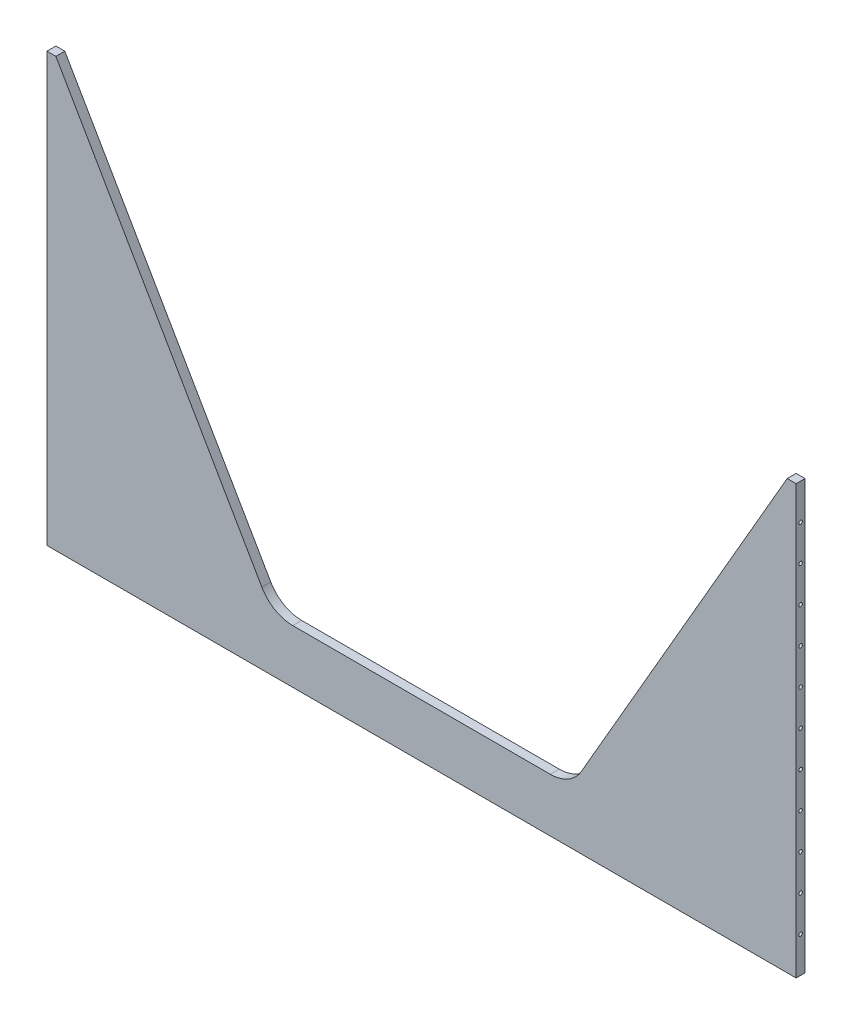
ISO-10303-21;
HEADER;
FILE_DESCRIPTION(('STEP AP214'),'2;1');
FILE_NAME('part.step','',(''),(''),'','','');
FILE_SCHEMA(('AUTOMOTIVE_DESIGN { 1 0 10303 214 1 1 1 1 }'));
ENDSEC;
DATA;
#1=APPLICATION_CONTEXT('core data for automotive mechanical design processes');
#2=APPLICATION_PROTOCOL_DEFINITION('international standard','automotive_design',2000,#1);
#3=PRODUCT_CONTEXT('',#1,'mechanical');
#4=PRODUCT('Part','Part','',(#3));
#5=PRODUCT_RELATED_PRODUCT_CATEGORY('part','',(#4));
#6=PRODUCT_DEFINITION_FORMATION('','',#4);
#7=PRODUCT_DEFINITION_CONTEXT('part definition',#1,'design');
#8=PRODUCT_DEFINITION('design','',#6,#7);
#9=PRODUCT_DEFINITION_SHAPE('','',#8);
#10=(LENGTH_UNIT() NAMED_UNIT(*) SI_UNIT(.MILLI.,.METRE.));
#11=(NAMED_UNIT(*) PLANE_ANGLE_UNIT() SI_UNIT($,.RADIAN.));
#12=(NAMED_UNIT(*) SI_UNIT($,.STERADIAN.) SOLID_ANGLE_UNIT());
#13=UNCERTAINTY_MEASURE_WITH_UNIT(LENGTH_MEASURE(1.E-05),#10,'distance_accuracy_value','');
#14=(GEOMETRIC_REPRESENTATION_CONTEXT(3) GLOBAL_UNCERTAINTY_ASSIGNED_CONTEXT((#13)) GLOBAL_UNIT_ASSIGNED_CONTEXT((#10,
#11,#12)) REPRESENTATION_CONTEXT('',''));
#15=CARTESIAN_POINT('',(0.,0.,0.));
#16=DIRECTION('',(0.,0.,1.));
#17=DIRECTION('',(1.,0.,0.));
#18=AXIS2_PLACEMENT_3D('',#15,#16,#17);
#19=CARTESIAN_POINT('',(533.4,304.8,12.7));
#20=DIRECTION('',(-1.,0.,0.));
#21=DIRECTION('',(0.,0.,1.));
#22=AXIS2_PLACEMENT_3D('',#19,#20,#21);
#23=PLANE('',#22);
#24=CARTESIAN_POINT('',(533.4,254.,6.35));
#25=DIRECTION('',(1.,0.,0.));
#26=DIRECTION('',(0.,0.,-1.));
#27=AXIS2_PLACEMENT_3D('',#24,#25,#26);
#28=CIRCLE('',#27,2.55269999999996);
#29=CARTESIAN_POINT('',(533.4,254.,3.79730000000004));
#30=VERTEX_POINT('',#29);
#31=EDGE_CURVE('E253',#30,#30,#28,.T.);
#32=ORIENTED_EDGE('',*,*,#31,.F.);
#33=EDGE_LOOP('',(#32));
#34=FACE_BOUND('',#33,.T.);
#35=DIRECTION('',(0.,1.,0.));
#36=VECTOR('',#35,1.);
#37=CARTESIAN_POINT('',(533.4,304.8,0.));
#38=LINE('',#37,#36);
#39=CARTESIAN_POINT('',(533.4,-304.8,0.));
#40=VERTEX_POINT('',#39);
#41=CARTESIAN_POINT('',(533.4,304.8,0.));
#42=VERTEX_POINT('',#41);
#43=EDGE_CURVE('E418',#40,#42,#38,.T.);
#44=ORIENTED_EDGE('',*,*,#43,.T.);
#45=DIRECTION('',(0.,0.,-1.));
#46=VECTOR('',#45,1.);
#47=CARTESIAN_POINT('',(533.4,304.8,12.7));
#48=LINE('',#47,#46);
#49=CARTESIAN_POINT('',(533.4,304.8,12.7));
#50=VERTEX_POINT('',#49);
#51=EDGE_CURVE('E458',#50,#42,#48,.T.);
#52=ORIENTED_EDGE('',*,*,#51,.F.);
#53=DIRECTION('',(0.,1.,0.));
#54=VECTOR('',#53,1.);
#55=CARTESIAN_POINT('',(533.4,304.8,12.7));
#56=LINE('',#55,#54);
#57=CARTESIAN_POINT('',(533.4,-304.8,12.7));
#58=VERTEX_POINT('',#57);
#59=EDGE_CURVE('E428',#58,#50,#56,.T.);
#60=ORIENTED_EDGE('',*,*,#59,.F.);
#61=DIRECTION('',(0.,0.,-1.));
#62=VECTOR('',#61,1.);
#63=CARTESIAN_POINT('',(533.4,-304.8,12.7));
#64=LINE('',#63,#62);
#65=EDGE_CURVE('E440',#58,#40,#64,.T.);
#66=ORIENTED_EDGE('',*,*,#65,.T.);
#67=EDGE_LOOP('',(#44,#52,#60,#66));
#68=FACE_BOUND('',#67,.T.);
#69=CARTESIAN_POINT('',(533.4,-254.,6.35));
#70=DIRECTION('',(1.,0.,0.));
#71=DIRECTION('',(0.,0.,-1.));
#72=AXIS2_PLACEMENT_3D('',#69,#70,#71);
#73=CIRCLE('',#72,2.55269999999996);
#74=CARTESIAN_POINT('',(533.4,-254.,3.79730000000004));
#75=VERTEX_POINT('',#74);
#76=EDGE_CURVE('E313',#75,#75,#73,.T.);
#77=ORIENTED_EDGE('',*,*,#76,.F.);
#78=EDGE_LOOP('',(#77));
#79=FACE_BOUND('',#78,.T.);
#80=CARTESIAN_POINT('',(533.4,-203.2,6.35));
#81=DIRECTION('',(1.,0.,0.));
#82=DIRECTION('',(0.,0.,-1.));
#83=AXIS2_PLACEMENT_3D('',#80,#81,#82);
#84=CIRCLE('',#83,2.55269999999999);
#85=CARTESIAN_POINT('',(533.4,-203.2,3.79730000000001));
#86=VERTEX_POINT('',#85);
#87=EDGE_CURVE('E307',#86,#86,#84,.T.);
#88=ORIENTED_EDGE('',*,*,#87,.F.);
#89=EDGE_LOOP('',(#88));
#90=FACE_BOUND('',#89,.T.);
#91=CARTESIAN_POINT('',(533.4,-152.4,6.35));
#92=DIRECTION('',(1.,0.,0.));
#93=DIRECTION('',(0.,0.,-1.));
#94=AXIS2_PLACEMENT_3D('',#91,#92,#93);
#95=CIRCLE('',#94,2.55269999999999);
#96=CARTESIAN_POINT('',(533.4,-152.4,3.79730000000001));
#97=VERTEX_POINT('',#96);
#98=EDGE_CURVE('E301',#97,#97,#95,.T.);
#99=ORIENTED_EDGE('',*,*,#98,.F.);
#100=EDGE_LOOP('',(#99));
#101=FACE_BOUND('',#100,.T.);
#102=CARTESIAN_POINT('',(533.4,-101.6,6.35));
#103=DIRECTION('',(1.,0.,0.));
#104=DIRECTION('',(0.,0.,-1.));
#105=AXIS2_PLACEMENT_3D('',#102,#103,#104);
#106=CIRCLE('',#105,2.55269999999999);
#107=CARTESIAN_POINT('',(533.4,-101.6,3.79730000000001));
#108=VERTEX_POINT('',#107);
#109=EDGE_CURVE('E295',#108,#108,#106,.T.);
#110=ORIENTED_EDGE('',*,*,#109,.F.);
#111=EDGE_LOOP('',(#110));
#112=FACE_BOUND('',#111,.T.);
#113=CARTESIAN_POINT('',(533.4,-50.8,6.35));
#114=DIRECTION('',(1.,0.,0.));
#115=DIRECTION('',(0.,0.,-1.));
#116=AXIS2_PLACEMENT_3D('',#113,#114,#115);
#117=CIRCLE('',#116,2.55269999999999);
#118=CARTESIAN_POINT('',(533.4,-50.8,3.79730000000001));
#119=VERTEX_POINT('',#118);
#120=EDGE_CURVE('E289',#119,#119,#117,.T.);
#121=ORIENTED_EDGE('',*,*,#120,.F.);
#122=EDGE_LOOP('',(#121));
#123=FACE_BOUND('',#122,.T.);
#124=CARTESIAN_POINT('',(533.4,0.,6.35));
#125=DIRECTION('',(1.,0.,0.));
#126=DIRECTION('',(0.,0.,-1.));
#127=AXIS2_PLACEMENT_3D('',#124,#125,#126);
#128=CIRCLE('',#127,2.55269999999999);
#129=CARTESIAN_POINT('',(533.4,0.,3.79730000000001));
#130=VERTEX_POINT('',#129);
#131=EDGE_CURVE('E283',#130,#130,#128,.T.);
#132=ORIENTED_EDGE('',*,*,#131,.F.);
#133=EDGE_LOOP('',(#132));
#134=FACE_BOUND('',#133,.T.);
#135=CARTESIAN_POINT('',(533.4,50.8,6.35));
#136=DIRECTION('',(1.,0.,0.));
#137=DIRECTION('',(0.,0.,-1.));
#138=AXIS2_PLACEMENT_3D('',#135,#136,#137);
#139=CIRCLE('',#138,2.55269999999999);
#140=CARTESIAN_POINT('',(533.4,50.8,3.79730000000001));
#141=VERTEX_POINT('',#140);
#142=EDGE_CURVE('E277',#141,#141,#139,.T.);
#143=ORIENTED_EDGE('',*,*,#142,.F.);
#144=EDGE_LOOP('',(#143));
#145=FACE_BOUND('',#144,.T.);
#146=CARTESIAN_POINT('',(533.4,101.6,6.35));
#147=DIRECTION('',(1.,0.,0.));
#148=DIRECTION('',(0.,0.,-1.));
#149=AXIS2_PLACEMENT_3D('',#146,#147,#148);
#150=CIRCLE('',#149,2.55269999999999);
#151=CARTESIAN_POINT('',(533.4,101.6,3.79730000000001));
#152=VERTEX_POINT('',#151);
#153=EDGE_CURVE('E271',#152,#152,#150,.T.);
#154=ORIENTED_EDGE('',*,*,#153,.F.);
#155=EDGE_LOOP('',(#154));
#156=FACE_BOUND('',#155,.T.);
#157=CARTESIAN_POINT('',(533.4,152.4,6.35));
#158=DIRECTION('',(1.,0.,0.));
#159=DIRECTION('',(0.,0.,-1.));
#160=AXIS2_PLACEMENT_3D('',#157,#158,#159);
#161=CIRCLE('',#160,2.55269999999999);
#162=CARTESIAN_POINT('',(533.4,152.4,3.79730000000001));
#163=VERTEX_POINT('',#162);
#164=EDGE_CURVE('E265',#163,#163,#161,.T.);
#165=ORIENTED_EDGE('',*,*,#164,.F.);
#166=EDGE_LOOP('',(#165));
#167=FACE_BOUND('',#166,.T.);
#168=CARTESIAN_POINT('',(533.4,203.2,6.35));
#169=DIRECTION('',(1.,0.,0.));
#170=DIRECTION('',(0.,0.,-1.));
#171=AXIS2_PLACEMENT_3D('',#168,#169,#170);
#172=CIRCLE('',#171,2.55269999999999);
#173=CARTESIAN_POINT('',(533.4,203.2,3.79730000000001));
#174=VERTEX_POINT('',#173);
#175=EDGE_CURVE('E259',#174,#174,#172,.T.);
#176=ORIENTED_EDGE('',*,*,#175,.F.);
#177=EDGE_LOOP('',(#176));
#178=FACE_BOUND('',#177,.T.);
#179=ADVANCED_FACE('F37',(#34,#68,#79,#90,#101,#112,#123,#134,#145,#156,#167,#178),#23,.F.);
#180=CARTESIAN_POINT('',(-533.4,304.8,12.7));
#181=DIRECTION('',(0.,-1.,0.));
#182=DIRECTION('',(1.,0.,0.));
#183=AXIS2_PLACEMENT_3D('',#180,#181,#182);
#184=PLANE('',#183);
#185=DIRECTION('',(-1.,0.,0.));
#186=VECTOR('',#185,1.);
#187=CARTESIAN_POINT('',(-533.4,304.8,0.));
#188=LINE('',#187,#186);
#189=CARTESIAN_POINT('',(520.7,304.8,0.));
#190=VERTEX_POINT('',#189);
#191=EDGE_CURVE('E444',#42,#190,#188,.T.);
#192=ORIENTED_EDGE('',*,*,#191,.T.);
#193=DIRECTION('',(0.,0.,1.));
#194=VECTOR('',#193,1.);
#195=CARTESIAN_POINT('',(520.7,304.8,0.));
#196=LINE('',#195,#194);
#197=CARTESIAN_POINT('',(520.7,304.8,12.7));
#198=VERTEX_POINT('',#197);
#199=EDGE_CURVE('E415',#190,#198,#196,.T.);
#200=ORIENTED_EDGE('',*,*,#199,.T.);
#201=DIRECTION('',(-1.,0.,0.));
#202=VECTOR('',#201,1.);
#203=CARTESIAN_POINT('',(-533.4,304.8,12.7));
#204=LINE('',#203,#202);
#205=EDGE_CURVE('E433',#50,#198,#204,.T.);
#206=ORIENTED_EDGE('',*,*,#205,.F.);
#207=ORIENTED_EDGE('',*,*,#51,.T.);
#208=EDGE_LOOP('',(#192,#200,#206,#207));
#209=FACE_BOUND('',#208,.T.);
#210=ADVANCED_FACE('F586',(#209),#184,.F.);
#211=CARTESIAN_POINT('',(-520.7,304.8,12.7));
#212=VERTEX_POINT('',#211);
#213=CARTESIAN_POINT('',(-533.4,304.8,12.7));
#214=VERTEX_POINT('',#213);
#215=EDGE_CURVE('E431',#212,#214,#204,.T.);
#216=ORIENTED_EDGE('',*,*,#215,.F.);
#217=DIRECTION('',(0.,0.,1.));
#218=VECTOR('',#217,1.);
#219=CARTESIAN_POINT('',(-520.7,304.8,0.));
#220=LINE('',#219,#218);
#221=CARTESIAN_POINT('',(-520.7,304.8,0.));
#222=VERTEX_POINT('',#221);
#223=EDGE_CURVE('E402',#222,#212,#220,.T.);
#224=ORIENTED_EDGE('',*,*,#223,.F.);
#225=CARTESIAN_POINT('',(-533.4,304.8,0.));
#226=VERTEX_POINT('',#225);
#227=EDGE_CURVE('E443',#222,#226,#188,.T.);
#228=ORIENTED_EDGE('',*,*,#227,.T.);
#229=DIRECTION('',(0.,0.,-1.));
#230=VECTOR('',#229,1.);
#231=CARTESIAN_POINT('',(-533.4,304.8,12.7));
#232=LINE('',#231,#230);
#233=EDGE_CURVE('E455',#214,#226,#232,.T.);
#234=ORIENTED_EDGE('',*,*,#233,.F.);
#235=EDGE_LOOP('',(#216,#224,#228,#234));
#236=FACE_BOUND('',#235,.T.);
#237=ADVANCED_FACE('F579',(#236),#184,.F.);
#238=CARTESIAN_POINT('',(-533.4,304.8,12.7));
#239=DIRECTION('',(1.,0.,0.));
#240=DIRECTION('',(0.,0.,-1.));
#241=AXIS2_PLACEMENT_3D('',#238,#239,#240);
#242=PLANE('',#241);
#243=CARTESIAN_POINT('',(-533.4,254.,6.35));
#244=DIRECTION('',(-1.,0.,0.));
#245=DIRECTION('',(0.,0.,1.));
#246=AXIS2_PLACEMENT_3D('',#243,#244,#245);
#247=CIRCLE('',#246,2.55269999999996);
#248=CARTESIAN_POINT('',(-533.4,254.,8.90269999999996));
#249=VERTEX_POINT('',#248);
#250=EDGE_CURVE('E319',#249,#249,#247,.T.);
#251=ORIENTED_EDGE('',*,*,#250,.F.);
#252=EDGE_LOOP('',(#251));
#253=FACE_BOUND('',#252,.T.);
#254=CARTESIAN_POINT('',(-533.4,203.2,6.35));
#255=DIRECTION('',(-1.,0.,0.));
#256=DIRECTION('',(0.,0.,1.));
#257=AXIS2_PLACEMENT_3D('',#254,#255,#256);
#258=CIRCLE('',#257,2.55269999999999);
#259=CARTESIAN_POINT('',(-533.4,203.2,8.90269999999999));
#260=VERTEX_POINT('',#259);
#261=EDGE_CURVE('E325',#260,#260,#258,.T.);
#262=ORIENTED_EDGE('',*,*,#261,.F.);
#263=EDGE_LOOP('',(#262));
#264=FACE_BOUND('',#263,.T.);
#265=CARTESIAN_POINT('',(-533.4,152.4,6.35));
#266=DIRECTION('',(-1.,0.,0.));
#267=DIRECTION('',(0.,0.,1.));
#268=AXIS2_PLACEMENT_3D('',#265,#266,#267);
#269=CIRCLE('',#268,2.55269999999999);
#270=CARTESIAN_POINT('',(-533.4,152.4,8.90269999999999));
#271=VERTEX_POINT('',#270);
#272=EDGE_CURVE('E331',#271,#271,#269,.T.);
#273=ORIENTED_EDGE('',*,*,#272,.F.);
#274=EDGE_LOOP('',(#273));
#275=FACE_BOUND('',#274,.T.);
#276=CARTESIAN_POINT('',(-533.4,101.6,6.35));
#277=DIRECTION('',(-1.,0.,0.));
#278=DIRECTION('',(0.,0.,1.));
#279=AXIS2_PLACEMENT_3D('',#276,#277,#278);
#280=CIRCLE('',#279,2.55269999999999);
#281=CARTESIAN_POINT('',(-533.4,101.6,8.90269999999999));
#282=VERTEX_POINT('',#281);
#283=EDGE_CURVE('E337',#282,#282,#280,.T.);
#284=ORIENTED_EDGE('',*,*,#283,.F.);
#285=EDGE_LOOP('',(#284));
#286=FACE_BOUND('',#285,.T.);
#287=CARTESIAN_POINT('',(-533.4,50.8,6.35));
#288=DIRECTION('',(-1.,0.,0.));
#289=DIRECTION('',(0.,0.,1.));
#290=AXIS2_PLACEMENT_3D('',#287,#288,#289);
#291=CIRCLE('',#290,2.55269999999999);
#292=CARTESIAN_POINT('',(-533.4,50.8,8.90269999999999));
#293=VERTEX_POINT('',#292);
#294=EDGE_CURVE('E343',#293,#293,#291,.T.);
#295=ORIENTED_EDGE('',*,*,#294,.F.);
#296=EDGE_LOOP('',(#295));
#297=FACE_BOUND('',#296,.T.);
#298=CARTESIAN_POINT('',(-533.4,0.,6.35));
#299=DIRECTION('',(-1.,0.,0.));
#300=DIRECTION('',(0.,0.,1.));
#301=AXIS2_PLACEMENT_3D('',#298,#299,#300);
#302=CIRCLE('',#301,2.55269999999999);
#303=CARTESIAN_POINT('',(-533.4,0.,8.90269999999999));
#304=VERTEX_POINT('',#303);
#305=EDGE_CURVE('E349',#304,#304,#302,.T.);
#306=ORIENTED_EDGE('',*,*,#305,.F.);
#307=EDGE_LOOP('',(#306));
#308=FACE_BOUND('',#307,.T.);
#309=CARTESIAN_POINT('',(-533.4,-50.8,6.35));
#310=DIRECTION('',(-1.,0.,0.));
#311=DIRECTION('',(0.,0.,1.));
#312=AXIS2_PLACEMENT_3D('',#309,#310,#311);
#313=CIRCLE('',#312,2.55269999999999);
#314=CARTESIAN_POINT('',(-533.4,-50.8,8.90269999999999));
#315=VERTEX_POINT('',#314);
#316=EDGE_CURVE('E355',#315,#315,#313,.T.);
#317=ORIENTED_EDGE('',*,*,#316,.F.);
#318=EDGE_LOOP('',(#317));
#319=FACE_BOUND('',#318,.T.);
#320=CARTESIAN_POINT('',(-533.4,-101.6,6.35));
#321=DIRECTION('',(-1.,0.,0.));
#322=DIRECTION('',(0.,0.,1.));
#323=AXIS2_PLACEMENT_3D('',#320,#321,#322);
#324=CIRCLE('',#323,2.55269999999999);
#325=CARTESIAN_POINT('',(-533.4,-101.6,8.90269999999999));
#326=VERTEX_POINT('',#325);
#327=EDGE_CURVE('E361',#326,#326,#324,.T.);
#328=ORIENTED_EDGE('',*,*,#327,.F.);
#329=EDGE_LOOP('',(#328));
#330=FACE_BOUND('',#329,.T.);
#331=CARTESIAN_POINT('',(-533.4,-152.4,6.35));
#332=DIRECTION('',(-1.,0.,0.));
#333=DIRECTION('',(0.,0.,1.));
#334=AXIS2_PLACEMENT_3D('',#331,#332,#333);
#335=CIRCLE('',#334,2.55269999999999);
#336=CARTESIAN_POINT('',(-533.4,-152.4,8.90269999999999));
#337=VERTEX_POINT('',#336);
#338=EDGE_CURVE('E367',#337,#337,#335,.T.);
#339=ORIENTED_EDGE('',*,*,#338,.F.);
#340=EDGE_LOOP('',(#339));
#341=FACE_BOUND('',#340,.T.);
#342=CARTESIAN_POINT('',(-533.4,-203.2,6.35));
#343=DIRECTION('',(-1.,0.,0.));
#344=DIRECTION('',(0.,0.,1.));
#345=AXIS2_PLACEMENT_3D('',#342,#343,#344);
#346=CIRCLE('',#345,2.55269999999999);
#347=CARTESIAN_POINT('',(-533.4,-203.2,8.90269999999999));
#348=VERTEX_POINT('',#347);
#349=EDGE_CURVE('E373',#348,#348,#346,.T.);
#350=ORIENTED_EDGE('',*,*,#349,.F.);
#351=EDGE_LOOP('',(#350));
#352=FACE_BOUND('',#351,.T.);
#353=CARTESIAN_POINT('',(-533.4,-254.,6.35));
#354=DIRECTION('',(-1.,0.,0.));
#355=DIRECTION('',(0.,0.,1.));
#356=AXIS2_PLACEMENT_3D('',#353,#354,#355);
#357=CIRCLE('',#356,2.55269999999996);
#358=CARTESIAN_POINT('',(-533.4,-254.,8.90269999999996));
#359=VERTEX_POINT('',#358);
#360=EDGE_CURVE('E379',#359,#359,#357,.T.);
#361=ORIENTED_EDGE('',*,*,#360,.F.);
#362=EDGE_LOOP('',(#361));
#363=FACE_BOUND('',#362,.T.);
#364=DIRECTION('',(0.,-1.,0.));
#365=VECTOR('',#364,1.);
#366=CARTESIAN_POINT('',(-533.4,304.8,0.));
#367=LINE('',#366,#365);
#368=CARTESIAN_POINT('',(-533.4,-304.8,0.));
#369=VERTEX_POINT('',#368);
#370=EDGE_CURVE('E447',#226,#369,#367,.T.);
#371=ORIENTED_EDGE('',*,*,#370,.T.);
#372=DIRECTION('',(0.,0.,-1.));
#373=VECTOR('',#372,1.);
#374=CARTESIAN_POINT('',(-533.4,-304.8,12.7));
#375=LINE('',#374,#373);
#376=CARTESIAN_POINT('',(-533.4,-304.8,12.7));
#377=VERTEX_POINT('',#376);
#378=EDGE_CURVE('E452',#377,#369,#375,.T.);
#379=ORIENTED_EDGE('',*,*,#378,.F.);
#380=DIRECTION('',(0.,-1.,0.));
#381=VECTOR('',#380,1.);
#382=CARTESIAN_POINT('',(-533.4,304.8,12.7));
#383=LINE('',#382,#381);
#384=EDGE_CURVE('E436',#214,#377,#383,.T.);
#385=ORIENTED_EDGE('',*,*,#384,.F.);
#386=ORIENTED_EDGE('',*,*,#233,.T.);
#387=EDGE_LOOP('',(#371,#379,#385,#386));
#388=FACE_BOUND('',#387,.T.);
#389=ADVANCED_FACE('F569',(#253,#264,#275,#286,#297,#308,#319,#330,#341,#352,#363,#388),#242,.F.);
#390=CARTESIAN_POINT('',(-533.4,-304.8,12.7));
#391=DIRECTION('',(0.,1.,0.));
#392=DIRECTION('',(0.,0.,1.));
#393=AXIS2_PLACEMENT_3D('',#390,#391,#392);
#394=PLANE('',#393);
#395=CARTESIAN_POINT('',(-431.8,-304.8,6.35000000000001));
#396=DIRECTION('',(0.,-1.,0.));
#397=DIRECTION('',(0.,0.,-1.));
#398=AXIS2_PLACEMENT_3D('',#395,#396,#397);
#399=CIRCLE('',#398,2.55269999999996);
#400=CARTESIAN_POINT('',(-431.8,-304.8,3.79730000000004));
#401=VERTEX_POINT('',#400);
#402=EDGE_CURVE('E243',#401,#401,#399,.T.);
#403=ORIENTED_EDGE('',*,*,#402,.F.);
#404=EDGE_LOOP('',(#403));
#405=FACE_BOUND('',#404,.T.);
#406=CARTESIAN_POINT('',(-482.6,-304.8,6.35000000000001));
#407=DIRECTION('',(0.,-1.,0.));
#408=DIRECTION('',(0.,0.,-1.));
#409=AXIS2_PLACEMENT_3D('',#406,#407,#408);
#410=CIRCLE('',#409,2.55269999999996);
#411=CARTESIAN_POINT('',(-482.6,-304.8,3.79730000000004));
#412=VERTEX_POINT('',#411);
#413=EDGE_CURVE('E242',#412,#412,#410,.T.);
#414=ORIENTED_EDGE('',*,*,#413,.F.);
#415=EDGE_LOOP('',(#414));
#416=FACE_BOUND('',#415,.T.);
#417=DIRECTION('',(1.,0.,0.));
#418=VECTOR('',#417,1.);
#419=CARTESIAN_POINT('',(-533.4,-304.8,0.));
#420=LINE('',#419,#418);
#421=EDGE_CURVE('E432',#369,#40,#420,.T.);
#422=ORIENTED_EDGE('',*,*,#421,.T.);
#423=ORIENTED_EDGE('',*,*,#65,.F.);
#424=DIRECTION('',(1.,0.,0.));
#425=VECTOR('',#424,1.);
#426=CARTESIAN_POINT('',(-533.4,-304.8,12.7));
#427=LINE('',#426,#425);
#428=EDGE_CURVE('E438',#377,#58,#427,.T.);
#429=ORIENTED_EDGE('',*,*,#428,.F.);
#430=ORIENTED_EDGE('',*,*,#378,.T.);
#431=EDGE_LOOP('',(#422,#423,#429,#430));
#432=FACE_BOUND('',#431,.T.);
#433=CARTESIAN_POINT('',(-381.,-304.8,6.35000000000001));
#434=DIRECTION('',(0.,-1.,0.));
#435=DIRECTION('',(0.,0.,-1.));
#436=AXIS2_PLACEMENT_3D('',#433,#434,#435);
#437=CIRCLE('',#436,2.55269999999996);
#438=CARTESIAN_POINT('',(-381.,-304.8,3.79730000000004));
#439=VERTEX_POINT('',#438);
#440=EDGE_CURVE('E461',#439,#439,#437,.T.);
#441=ORIENTED_EDGE('',*,*,#440,.F.);
#442=EDGE_LOOP('',(#441));
#443=FACE_BOUND('',#442,.T.);
#444=CARTESIAN_POINT('',(-330.2,-304.8,6.35000000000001));
#445=DIRECTION('',(0.,-1.,0.));
#446=DIRECTION('',(0.,0.,-1.));
#447=AXIS2_PLACEMENT_3D('',#444,#445,#446);
#448=CIRCLE('',#447,2.55269999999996);
#449=CARTESIAN_POINT('',(-330.2,-304.8,3.79730000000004));
#450=VERTEX_POINT('',#449);
#451=EDGE_CURVE('E467',#450,#450,#448,.T.);
#452=ORIENTED_EDGE('',*,*,#451,.F.);
#453=EDGE_LOOP('',(#452));
#454=FACE_BOUND('',#453,.T.);
#455=CARTESIAN_POINT('',(-279.4,-304.8,6.35000000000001));
#456=DIRECTION('',(0.,-1.,0.));
#457=DIRECTION('',(0.,0.,-1.));
#458=AXIS2_PLACEMENT_3D('',#455,#456,#457);
#459=CIRCLE('',#458,2.55269999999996);
#460=CARTESIAN_POINT('',(-279.4,-304.8,3.79730000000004));
#461=VERTEX_POINT('',#460);
#462=EDGE_CURVE('E473',#461,#461,#459,.T.);
#463=ORIENTED_EDGE('',*,*,#462,.F.);
#464=EDGE_LOOP('',(#463));
#465=FACE_BOUND('',#464,.T.);
#466=CARTESIAN_POINT('',(-228.6,-304.8,6.35000000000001));
#467=DIRECTION('',(0.,-1.,0.));
#468=DIRECTION('',(0.,0.,-1.));
#469=AXIS2_PLACEMENT_3D('',#466,#467,#468);
#470=CIRCLE('',#469,2.55269999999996);
#471=CARTESIAN_POINT('',(-228.6,-304.8,3.79730000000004));
#472=VERTEX_POINT('',#471);
#473=EDGE_CURVE('E479',#472,#472,#470,.T.);
#474=ORIENTED_EDGE('',*,*,#473,.F.);
#475=EDGE_LOOP('',(#474));
#476=FACE_BOUND('',#475,.T.);
#477=CARTESIAN_POINT('',(-177.8,-304.8,6.35000000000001));
#478=DIRECTION('',(0.,-1.,0.));
#479=DIRECTION('',(0.,0.,-1.));
#480=AXIS2_PLACEMENT_3D('',#477,#478,#479);
#481=CIRCLE('',#480,2.55269999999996);
#482=CARTESIAN_POINT('',(-177.8,-304.8,3.79730000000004));
#483=VERTEX_POINT('',#482);
#484=EDGE_CURVE('E485',#483,#483,#481,.T.);
#485=ORIENTED_EDGE('',*,*,#484,.F.);
#486=EDGE_LOOP('',(#485));
#487=FACE_BOUND('',#486,.T.);
#488=CARTESIAN_POINT('',(-127.,-304.8,6.35000000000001));
#489=DIRECTION('',(0.,-1.,0.));
#490=DIRECTION('',(0.,0.,-1.));
#491=AXIS2_PLACEMENT_3D('',#488,#489,#490);
#492=CIRCLE('',#491,2.55269999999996);
#493=CARTESIAN_POINT('',(-127.,-304.8,3.79730000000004));
#494=VERTEX_POINT('',#493);
#495=EDGE_CURVE('E491',#494,#494,#492,.T.);
#496=ORIENTED_EDGE('',*,*,#495,.F.);
#497=EDGE_LOOP('',(#496));
#498=FACE_BOUND('',#497,.T.);
#499=CARTESIAN_POINT('',(-76.1999999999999,-304.8,6.35000000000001));
#500=DIRECTION('',(0.,-1.,0.));
#501=DIRECTION('',(0.,0.,-1.));
#502=AXIS2_PLACEMENT_3D('',#499,#500,#501);
#503=CIRCLE('',#502,2.55269999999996);
#504=CARTESIAN_POINT('',(-76.1999999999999,-304.8,3.79730000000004));
#505=VERTEX_POINT('',#504);
#506=EDGE_CURVE('E497',#505,#505,#503,.T.);
#507=ORIENTED_EDGE('',*,*,#506,.F.);
#508=EDGE_LOOP('',(#507));
#509=FACE_BOUND('',#508,.T.);
#510=CARTESIAN_POINT('',(-25.3999999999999,-304.8,6.35000000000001));
#511=DIRECTION('',(0.,-1.,0.));
#512=DIRECTION('',(0.,0.,-1.));
#513=AXIS2_PLACEMENT_3D('',#510,#511,#512);
#514=CIRCLE('',#513,2.55269999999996);
#515=CARTESIAN_POINT('',(-25.3999999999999,-304.8,3.79730000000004));
#516=VERTEX_POINT('',#515);
#517=EDGE_CURVE('E503',#516,#516,#514,.T.);
#518=ORIENTED_EDGE('',*,*,#517,.F.);
#519=EDGE_LOOP('',(#518));
#520=FACE_BOUND('',#519,.T.);
#521=CARTESIAN_POINT('',(25.4000000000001,-304.8,6.35000000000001));
#522=DIRECTION('',(0.,-1.,0.));
#523=DIRECTION('',(0.,0.,-1.));
#524=AXIS2_PLACEMENT_3D('',#521,#522,#523);
#525=CIRCLE('',#524,2.55269999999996);
#526=CARTESIAN_POINT('',(25.4000000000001,-304.8,3.79730000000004));
#527=VERTEX_POINT('',#526);
#528=EDGE_CURVE('E509',#527,#527,#525,.T.);
#529=ORIENTED_EDGE('',*,*,#528,.F.);
#530=EDGE_LOOP('',(#529));
#531=FACE_BOUND('',#530,.T.);
#532=CARTESIAN_POINT('',(76.2000000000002,-304.8,6.35000000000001));
#533=DIRECTION('',(0.,-1.,0.));
#534=DIRECTION('',(0.,0.,-1.));
#535=AXIS2_PLACEMENT_3D('',#532,#533,#534);
#536=CIRCLE('',#535,2.55269999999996);
#537=CARTESIAN_POINT('',(76.2000000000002,-304.8,3.79730000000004));
#538=VERTEX_POINT('',#537);
#539=EDGE_CURVE('E515',#538,#538,#536,.T.);
#540=ORIENTED_EDGE('',*,*,#539,.F.);
#541=EDGE_LOOP('',(#540));
#542=FACE_BOUND('',#541,.T.);
#543=CARTESIAN_POINT('',(127.,-304.8,6.35000000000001));
#544=DIRECTION('',(0.,-1.,0.));
#545=DIRECTION('',(0.,0.,-1.));
#546=AXIS2_PLACEMENT_3D('',#543,#544,#545);
#547=CIRCLE('',#546,2.55269999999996);
#548=CARTESIAN_POINT('',(127.,-304.8,3.79730000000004));
#549=VERTEX_POINT('',#548);
#550=EDGE_CURVE('E521',#549,#549,#547,.T.);
#551=ORIENTED_EDGE('',*,*,#550,.F.);
#552=EDGE_LOOP('',(#551));
#553=FACE_BOUND('',#552,.T.);
#554=CARTESIAN_POINT('',(177.8,-304.8,6.35000000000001));
#555=DIRECTION('',(0.,-1.,0.));
#556=DIRECTION('',(0.,0.,-1.));
#557=AXIS2_PLACEMENT_3D('',#554,#555,#556);
#558=CIRCLE('',#557,2.55269999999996);
#559=CARTESIAN_POINT('',(177.8,-304.8,3.79730000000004));
#560=VERTEX_POINT('',#559);
#561=EDGE_CURVE('E527',#560,#560,#558,.T.);
#562=ORIENTED_EDGE('',*,*,#561,.F.);
#563=EDGE_LOOP('',(#562));
#564=FACE_BOUND('',#563,.T.);
#565=CARTESIAN_POINT('',(228.6,-304.8,6.35000000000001));
#566=DIRECTION('',(0.,-1.,0.));
#567=DIRECTION('',(0.,0.,-1.));
#568=AXIS2_PLACEMENT_3D('',#565,#566,#567);
#569=CIRCLE('',#568,2.55269999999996);
#570=CARTESIAN_POINT('',(228.6,-304.8,3.79730000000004));
#571=VERTEX_POINT('',#570);
#572=EDGE_CURVE('E533',#571,#571,#569,.T.);
#573=ORIENTED_EDGE('',*,*,#572,.F.);
#574=EDGE_LOOP('',(#573));
#575=FACE_BOUND('',#574,.T.);
#576=CARTESIAN_POINT('',(279.4,-304.8,6.35000000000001));
#577=DIRECTION('',(0.,-1.,0.));
#578=DIRECTION('',(0.,0.,-1.));
#579=AXIS2_PLACEMENT_3D('',#576,#577,#578);
#580=CIRCLE('',#579,2.55269999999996);
#581=CARTESIAN_POINT('',(279.4,-304.8,3.79730000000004));
#582=VERTEX_POINT('',#581);
#583=EDGE_CURVE('E539',#582,#582,#580,.T.);
#584=ORIENTED_EDGE('',*,*,#583,.F.);
#585=EDGE_LOOP('',(#584));
#586=FACE_BOUND('',#585,.T.);
#587=CARTESIAN_POINT('',(330.2,-304.8,6.35000000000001));
#588=DIRECTION('',(0.,-1.,0.));
#589=DIRECTION('',(0.,0.,-1.));
#590=AXIS2_PLACEMENT_3D('',#587,#588,#589);
#591=CIRCLE('',#590,2.55269999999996);
#592=CARTESIAN_POINT('',(330.2,-304.8,3.79730000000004));
#593=VERTEX_POINT('',#592);
#594=EDGE_CURVE('E545',#593,#593,#591,.T.);
#595=ORIENTED_EDGE('',*,*,#594,.F.);
#596=EDGE_LOOP('',(#595));
#597=FACE_BOUND('',#596,.T.);
#598=CARTESIAN_POINT('',(381.,-304.8,6.35000000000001));
#599=DIRECTION('',(0.,-1.,0.));
#600=DIRECTION('',(0.,0.,-1.));
#601=AXIS2_PLACEMENT_3D('',#598,#599,#600);
#602=CIRCLE('',#601,2.55269999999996);
#603=CARTESIAN_POINT('',(381.,-304.8,3.79730000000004));
#604=VERTEX_POINT('',#603);
#605=EDGE_CURVE('E551',#604,#604,#602,.T.);
#606=ORIENTED_EDGE('',*,*,#605,.F.);
#607=EDGE_LOOP('',(#606));
#608=FACE_BOUND('',#607,.T.);
#609=CARTESIAN_POINT('',(431.8,-304.8,6.35000000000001));
#610=DIRECTION('',(0.,-1.,0.));
#611=DIRECTION('',(0.,0.,-1.));
#612=AXIS2_PLACEMENT_3D('',#609,#610,#611);
#613=CIRCLE('',#612,2.55269999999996);
#614=CARTESIAN_POINT('',(431.8,-304.8,3.79730000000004));
#615=VERTEX_POINT('',#614);
#616=EDGE_CURVE('E557',#615,#615,#613,.T.);
#617=ORIENTED_EDGE('',*,*,#616,.F.);
#618=EDGE_LOOP('',(#617));
#619=FACE_BOUND('',#618,.T.);
#620=CARTESIAN_POINT('',(482.6,-304.8,6.35000000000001));
#621=DIRECTION('',(0.,-1.,0.));
#622=DIRECTION('',(0.,0.,-1.));
#623=AXIS2_PLACEMENT_3D('',#620,#621,#622);
#624=CIRCLE('',#623,2.55269999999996);
#625=CARTESIAN_POINT('',(482.6,-304.8,3.79730000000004));
#626=VERTEX_POINT('',#625);
#627=EDGE_CURVE('E45',#626,#626,#624,.T.);
#628=ORIENTED_EDGE('',*,*,#627,.F.);
#629=EDGE_LOOP('',(#628));
#630=FACE_BOUND('',#629,.T.);
#631=ADVANCED_FACE('F566',(#405,#416,#432,#443,#454,#465,#476,#487,#498,#509,#520,#531,#542,
#553,#564,#575,#586,#597,#608,#619,#630),#394,.F.);
#632=CARTESIAN_POINT('',(0.,0.,12.7));
#633=DIRECTION('',(0.,0.,1.));
#634=DIRECTION('',(1.,0.,0.));
#635=AXIS2_PLACEMENT_3D('',#632,#633,#634);
#636=PLANE('',#635);
#637=DIRECTION('',(0.500000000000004,0.866025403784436,0.));
#638=VECTOR('',#637,1.);
#639=CARTESIAN_POINT('',(227.406063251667,-203.2,12.7));
#640=LINE('',#639,#638);
#641=CARTESIAN_POINT('',(227.406063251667,-203.2,12.7));
#642=VERTEX_POINT('',#641);
#643=EDGE_CURVE('E390',#642,#198,#640,.T.);
#644=ORIENTED_EDGE('',*,*,#643,.F.);
#645=CARTESIAN_POINT('',(183.411972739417,-177.8,12.7));
#646=DIRECTION('',(0.,0.,1.));
#647=DIRECTION('',(1.,0.,0.));
#648=AXIS2_PLACEMENT_3D('',#645,#646,#647);
#649=CIRCLE('',#648,50.8);
#650=CARTESIAN_POINT('',(183.411972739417,-228.6,12.7));
#651=VERTEX_POINT('',#650);
#652=EDGE_CURVE('E411',#651,#642,#649,.T.);
#653=ORIENTED_EDGE('',*,*,#652,.F.);
#654=DIRECTION('',(1.,0.,0.));
#655=VECTOR('',#654,1.);
#656=CARTESIAN_POINT('',(-183.411972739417,-228.6,12.7));
#657=LINE('',#656,#655);
#658=CARTESIAN_POINT('',(-183.411972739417,-228.6,12.7));
#659=VERTEX_POINT('',#658);
#660=EDGE_CURVE('E408',#659,#651,#657,.T.);
#661=ORIENTED_EDGE('',*,*,#660,.F.);
#662=CARTESIAN_POINT('',(-183.411972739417,-177.8,12.7));
#663=DIRECTION('',(0.,0.,1.));
#664=DIRECTION('',(1.,0.,0.));
#665=AXIS2_PLACEMENT_3D('',#662,#663,#664);
#666=CIRCLE('',#665,50.8);
#667=CARTESIAN_POINT('',(-227.406063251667,-203.2,12.7));
#668=VERTEX_POINT('',#667);
#669=EDGE_CURVE('E405',#668,#659,#666,.T.);
#670=ORIENTED_EDGE('',*,*,#669,.F.);
#671=DIRECTION('',(0.500000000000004,-0.866025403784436,0.));
#672=VECTOR('',#671,1.);
#673=CARTESIAN_POINT('',(-520.7,304.8,12.7));
#674=LINE('',#673,#672);
#675=EDGE_CURVE('E385',#212,#668,#674,.T.);
#676=ORIENTED_EDGE('',*,*,#675,.F.);
#677=ORIENTED_EDGE('',*,*,#215,.T.);
#678=ORIENTED_EDGE('',*,*,#384,.T.);
#679=ORIENTED_EDGE('',*,*,#428,.T.);
#680=ORIENTED_EDGE('',*,*,#59,.T.);
#681=ORIENTED_EDGE('',*,*,#205,.T.);
#682=EDGE_LOOP('',(#644,#653,#661,#670,#676,#677,#678,#679,#680,#681));
#683=FACE_BOUND('',#682,.T.);
#684=ADVANCED_FACE('F568',(#683),#636,.T.);
#685=CARTESIAN_POINT('',(0.,0.,0.));
#686=DIRECTION('',(0.,0.,1.));
#687=DIRECTION('',(1.,0.,0.));
#688=AXIS2_PLACEMENT_3D('',#685,#686,#687);
#689=PLANE('',#688);
#690=CARTESIAN_POINT('',(183.411972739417,-177.8,0.));
#691=DIRECTION('',(0.,0.,1.));
#692=DIRECTION('',(1.,0.,0.));
#693=AXIS2_PLACEMENT_3D('',#690,#691,#692);
#694=CIRCLE('',#693,50.8);
#695=CARTESIAN_POINT('',(183.411972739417,-228.6,0.));
#696=VERTEX_POINT('',#695);
#697=CARTESIAN_POINT('',(227.406063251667,-203.2,0.));
#698=VERTEX_POINT('',#697);
#699=EDGE_CURVE('E396',#696,#698,#694,.T.);
#700=ORIENTED_EDGE('',*,*,#699,.T.);
#701=DIRECTION('',(0.500000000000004,0.866025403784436,0.));
#702=VECTOR('',#701,1.);
#703=CARTESIAN_POINT('',(227.406063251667,-203.2,0.));
#704=LINE('',#703,#702);
#705=EDGE_CURVE('E399',#698,#190,#704,.T.);
#706=ORIENTED_EDGE('',*,*,#705,.T.);
#707=ORIENTED_EDGE('',*,*,#191,.F.);
#708=ORIENTED_EDGE('',*,*,#43,.F.);
#709=ORIENTED_EDGE('',*,*,#421,.F.);
#710=ORIENTED_EDGE('',*,*,#370,.F.);
#711=ORIENTED_EDGE('',*,*,#227,.F.);
#712=DIRECTION('',(0.500000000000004,-0.866025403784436,0.));
#713=VECTOR('',#712,1.);
#714=CARTESIAN_POINT('',(-520.7,304.8,0.));
#715=LINE('',#714,#713);
#716=CARTESIAN_POINT('',(-227.406063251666,-203.2,0.));
#717=VERTEX_POINT('',#716);
#718=EDGE_CURVE('E386',#222,#717,#715,.T.);
#719=ORIENTED_EDGE('',*,*,#718,.T.);
#720=CARTESIAN_POINT('',(-183.411972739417,-177.8,0.));
#721=DIRECTION('',(0.,0.,1.));
#722=DIRECTION('',(1.,0.,0.));
#723=AXIS2_PLACEMENT_3D('',#720,#721,#722);
#724=CIRCLE('',#723,50.8);
#725=CARTESIAN_POINT('',(-183.411972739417,-228.6,0.));
#726=VERTEX_POINT('',#725);
#727=EDGE_CURVE('E389',#717,#726,#724,.T.);
#728=ORIENTED_EDGE('',*,*,#727,.T.);
#729=DIRECTION('',(1.,0.,0.));
#730=VECTOR('',#729,1.);
#731=CARTESIAN_POINT('',(-183.411972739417,-228.6,0.));
#732=LINE('',#731,#730);
#733=EDGE_CURVE('E393',#726,#696,#732,.T.);
#734=ORIENTED_EDGE('',*,*,#733,.T.);
#735=EDGE_LOOP('',(#700,#706,#707,#708,#709,#710,#711,#719,#728,#734));
#736=FACE_BOUND('',#735,.T.);
#737=ADVANCED_FACE('F576',(#736),#689,.F.);
#738=CARTESIAN_POINT('',(227.406063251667,-203.2,0.));
#739=DIRECTION('',(0.866025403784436,-0.500000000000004,0.));
#740=DIRECTION('',(0.500000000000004,0.866025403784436,0.));
#741=AXIS2_PLACEMENT_3D('',#738,#739,#740);
#742=PLANE('',#741);
#743=ORIENTED_EDGE('',*,*,#643,.T.);
#744=ORIENTED_EDGE('',*,*,#199,.F.);
#745=ORIENTED_EDGE('',*,*,#705,.F.);
#746=DIRECTION('',(0.,0.,1.));
#747=VECTOR('',#746,1.);
#748=CARTESIAN_POINT('',(227.406063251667,-203.2,0.));
#749=LINE('',#748,#747);
#750=EDGE_CURVE('E419',#698,#642,#749,.T.);
#751=ORIENTED_EDGE('',*,*,#750,.T.);
#752=EDGE_LOOP('',(#743,#744,#745,#751));
#753=FACE_BOUND('',#752,.T.);
#754=ADVANCED_FACE('F1310',(#753),#742,.F.);
#755=CARTESIAN_POINT('',(183.411972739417,-177.8,0.));
#756=DIRECTION('',(0.,0.,1.));
#757=DIRECTION('',(1.,0.,0.));
#758=AXIS2_PLACEMENT_3D('',#755,#756,#757);
#759=CYLINDRICAL_SURFACE('',#758,50.8);
#760=ORIENTED_EDGE('',*,*,#652,.T.);
#761=ORIENTED_EDGE('',*,*,#750,.F.);
#762=ORIENTED_EDGE('',*,*,#699,.F.);
#763=DIRECTION('',(0.,0.,1.));
#764=VECTOR('',#763,1.);
#765=CARTESIAN_POINT('',(183.411972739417,-228.6,0.));
#766=LINE('',#765,#764);
#767=EDGE_CURVE('E421',#696,#651,#766,.T.);
#768=ORIENTED_EDGE('',*,*,#767,.T.);
#769=EDGE_LOOP('',(#760,#761,#762,#768));
#770=FACE_BOUND('',#769,.T.);
#771=ADVANCED_FACE('F1302',(#770),#759,.F.);
#772=CARTESIAN_POINT('',(-183.411972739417,-228.6,0.));
#773=DIRECTION('',(0.,-1.,0.));
#774=DIRECTION('',(1.,0.,0.));
#775=AXIS2_PLACEMENT_3D('',#772,#773,#774);
#776=PLANE('',#775);
#777=ORIENTED_EDGE('',*,*,#660,.T.);
#778=ORIENTED_EDGE('',*,*,#767,.F.);
#779=ORIENTED_EDGE('',*,*,#733,.F.);
#780=DIRECTION('',(0.,0.,1.));
#781=VECTOR('',#780,1.);
#782=CARTESIAN_POINT('',(-183.411972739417,-228.6,0.));
#783=LINE('',#782,#781);
#784=EDGE_CURVE('E423',#726,#659,#783,.T.);
#785=ORIENTED_EDGE('',*,*,#784,.T.);
#786=EDGE_LOOP('',(#777,#778,#779,#785));
#787=FACE_BOUND('',#786,.T.);
#788=ADVANCED_FACE('F1294',(#787),#776,.F.);
#789=CARTESIAN_POINT('',(-183.411972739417,-177.8,0.));
#790=DIRECTION('',(0.,0.,1.));
#791=DIRECTION('',(1.,0.,0.));
#792=AXIS2_PLACEMENT_3D('',#789,#790,#791);
#793=CYLINDRICAL_SURFACE('',#792,50.8);
#794=ORIENTED_EDGE('',*,*,#669,.T.);
#795=ORIENTED_EDGE('',*,*,#784,.F.);
#796=ORIENTED_EDGE('',*,*,#727,.F.);
#797=DIRECTION('',(0.,0.,1.));
#798=VECTOR('',#797,1.);
#799=CARTESIAN_POINT('',(-227.406063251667,-203.2,0.));
#800=LINE('',#799,#798);
#801=EDGE_CURVE('E425',#717,#668,#800,.T.);
#802=ORIENTED_EDGE('',*,*,#801,.T.);
#803=EDGE_LOOP('',(#794,#795,#796,#802));
#804=FACE_BOUND('',#803,.T.);
#805=ADVANCED_FACE('F1286',(#804),#793,.F.);
#806=CARTESIAN_POINT('',(-520.7,304.8,0.));
#807=DIRECTION('',(-0.866025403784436,-0.500000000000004,0.));
#808=DIRECTION('',(0.500000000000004,-0.866025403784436,0.));
#809=AXIS2_PLACEMENT_3D('',#806,#807,#808);
#810=PLANE('',#809);
#811=ORIENTED_EDGE('',*,*,#675,.T.);
#812=ORIENTED_EDGE('',*,*,#801,.F.);
#813=ORIENTED_EDGE('',*,*,#718,.F.);
#814=ORIENTED_EDGE('',*,*,#223,.T.);
#815=EDGE_LOOP('',(#811,#812,#813,#814));
#816=FACE_BOUND('',#815,.T.);
#817=ADVANCED_FACE('F1277',(#816),#810,.F.);
#818=CARTESIAN_POINT('',(-520.065,-254.,6.35));
#819=DIRECTION('',(-1.,0.,0.));
#820=DIRECTION('',(0.,0.,1.));
#821=AXIS2_PLACEMENT_3D('',#818,#819,#820);
#822=CONICAL_SURFACE('',#821,2.55270000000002,1.02974425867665);
#823=CARTESIAN_POINT('',(-518.531183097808,-254.,6.35));
#824=VERTEX_POINT('',#823);
#825=VERTEX_LOOP('',#824);
#826=FACE_BOUND('',#825,.T.);
#827=CARTESIAN_POINT('',(-520.065,-254.,6.35));
#828=DIRECTION('',(-1.,0.,0.));
#829=DIRECTION('',(0.,0.,1.));
#830=AXIS2_PLACEMENT_3D('',#827,#828,#829);
#831=CIRCLE('',#830,2.55270000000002);
#832=CARTESIAN_POINT('',(-520.065,-254.,8.90270000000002));
#833=VERTEX_POINT('',#832);
#834=EDGE_CURVE('E382',#833,#833,#831,.T.);
#835=ORIENTED_EDGE('',*,*,#834,.T.);
#836=EDGE_LOOP('',(#835));
#837=FACE_BOUND('',#836,.T.);
#838=ADVANCED_FACE('F1269',(#826,#837),#822,.F.);
#839=CARTESIAN_POINT('',(-533.4,-254.,6.35));
#840=DIRECTION('',(-1.,0.,0.));
#841=DIRECTION('',(0.,0.,1.));
#842=AXIS2_PLACEMENT_3D('',#839,#840,#841);
#843=CYLINDRICAL_SURFACE('',#842,2.55269999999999);
#844=ORIENTED_EDGE('',*,*,#834,.F.);
#845=EDGE_LOOP('',(#844));
#846=FACE_BOUND('',#845,.T.);
#847=ORIENTED_EDGE('',*,*,#360,.T.);
#848=EDGE_LOOP('',(#847));
#849=FACE_BOUND('',#848,.T.);
#850=ADVANCED_FACE('F1260',(#846,#849),#843,.F.);
#851=CARTESIAN_POINT('',(-520.065,-203.2,6.35));
#852=DIRECTION('',(-1.,0.,0.));
#853=DIRECTION('',(0.,0.,1.));
#854=AXIS2_PLACEMENT_3D('',#851,#852,#853);
#855=CONICAL_SURFACE('',#854,2.55269999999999,1.02974425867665);
#856=CARTESIAN_POINT('',(-518.531183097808,-203.2,6.35));
#857=VERTEX_POINT('',#856);
#858=VERTEX_LOOP('',#857);
#859=FACE_BOUND('',#858,.T.);
#860=CARTESIAN_POINT('',(-520.065,-203.2,6.35));
#861=DIRECTION('',(-1.,0.,0.));
#862=DIRECTION('',(0.,0.,1.));
#863=AXIS2_PLACEMENT_3D('',#860,#861,#862);
#864=CIRCLE('',#863,2.55269999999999);
#865=CARTESIAN_POINT('',(-520.065,-203.2,8.90269999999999));
#866=VERTEX_POINT('',#865);
#867=EDGE_CURVE('E376',#866,#866,#864,.T.);
#868=ORIENTED_EDGE('',*,*,#867,.T.);
#869=EDGE_LOOP('',(#868));
#870=FACE_BOUND('',#869,.T.);
#871=ADVANCED_FACE('F1252',(#859,#870),#855,.F.);
#872=CARTESIAN_POINT('',(-533.4,-203.2,6.35));
#873=DIRECTION('',(-1.,0.,0.));
#874=DIRECTION('',(0.,0.,1.));
#875=AXIS2_PLACEMENT_3D('',#872,#873,#874);
#876=CYLINDRICAL_SURFACE('',#875,2.55269999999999);
#877=ORIENTED_EDGE('',*,*,#867,.F.);
#878=EDGE_LOOP('',(#877));
#879=FACE_BOUND('',#878,.T.);
#880=ORIENTED_EDGE('',*,*,#349,.T.);
#881=EDGE_LOOP('',(#880));
#882=FACE_BOUND('',#881,.T.);
#883=ADVANCED_FACE('F1244',(#879,#882),#876,.F.);
#884=CARTESIAN_POINT('',(-520.065,-152.4,6.35));
#885=DIRECTION('',(-1.,0.,0.));
#886=DIRECTION('',(0.,0.,1.));
#887=AXIS2_PLACEMENT_3D('',#884,#885,#886);
#888=CONICAL_SURFACE('',#887,2.55269999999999,1.02974425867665);
#889=CARTESIAN_POINT('',(-518.531183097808,-152.4,6.35));
#890=VERTEX_POINT('',#889);
#891=VERTEX_LOOP('',#890);
#892=FACE_BOUND('',#891,.T.);
#893=CARTESIAN_POINT('',(-520.065,-152.4,6.35));
#894=DIRECTION('',(-1.,0.,0.));
#895=DIRECTION('',(0.,0.,1.));
#896=AXIS2_PLACEMENT_3D('',#893,#894,#895);
#897=CIRCLE('',#896,2.55269999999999);
#898=CARTESIAN_POINT('',(-520.065,-152.4,8.90269999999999));
#899=VERTEX_POINT('',#898);
#900=EDGE_CURVE('E370',#899,#899,#897,.T.);
#901=ORIENTED_EDGE('',*,*,#900,.T.);
#902=EDGE_LOOP('',(#901));
#903=FACE_BOUND('',#902,.T.);
#904=ADVANCED_FACE('F1236',(#892,#903),#888,.F.);
#905=CARTESIAN_POINT('',(-533.4,-152.4,6.35));
#906=DIRECTION('',(-1.,0.,0.));
#907=DIRECTION('',(0.,0.,1.));
#908=AXIS2_PLACEMENT_3D('',#905,#906,#907);
#909=CYLINDRICAL_SURFACE('',#908,2.55269999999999);
#910=ORIENTED_EDGE('',*,*,#900,.F.);
#911=EDGE_LOOP('',(#910));
#912=FACE_BOUND('',#911,.T.);
#913=ORIENTED_EDGE('',*,*,#338,.T.);
#914=EDGE_LOOP('',(#913));
#915=FACE_BOUND('',#914,.T.);
#916=ADVANCED_FACE('F1228',(#912,#915),#909,.F.);
#917=CARTESIAN_POINT('',(-520.065,-101.6,6.35));
#918=DIRECTION('',(-1.,0.,0.));
#919=DIRECTION('',(0.,0.,1.));
#920=AXIS2_PLACEMENT_3D('',#917,#918,#919);
#921=CONICAL_SURFACE('',#920,2.55269999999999,1.02974425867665);
#922=CARTESIAN_POINT('',(-518.531183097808,-101.6,6.35));
#923=VERTEX_POINT('',#922);
#924=VERTEX_LOOP('',#923);
#925=FACE_BOUND('',#924,.T.);
#926=CARTESIAN_POINT('',(-520.065,-101.6,6.35));
#927=DIRECTION('',(-1.,0.,0.));
#928=DIRECTION('',(0.,0.,1.));
#929=AXIS2_PLACEMENT_3D('',#926,#927,#928);
#930=CIRCLE('',#929,2.55269999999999);
#931=CARTESIAN_POINT('',(-520.065,-101.6,8.90269999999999));
#932=VERTEX_POINT('',#931);
#933=EDGE_CURVE('E364',#932,#932,#930,.T.);
#934=ORIENTED_EDGE('',*,*,#933,.T.);
#935=EDGE_LOOP('',(#934));
#936=FACE_BOUND('',#935,.T.);
#937=ADVANCED_FACE('F1220',(#925,#936),#921,.F.);
#938=CARTESIAN_POINT('',(-533.4,-101.6,6.35));
#939=DIRECTION('',(-1.,0.,0.));
#940=DIRECTION('',(0.,0.,1.));
#941=AXIS2_PLACEMENT_3D('',#938,#939,#940);
#942=CYLINDRICAL_SURFACE('',#941,2.55269999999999);
#943=ORIENTED_EDGE('',*,*,#933,.F.);
#944=EDGE_LOOP('',(#943));
#945=FACE_BOUND('',#944,.T.);
#946=ORIENTED_EDGE('',*,*,#327,.T.);
#947=EDGE_LOOP('',(#946));
#948=FACE_BOUND('',#947,.T.);
#949=ADVANCED_FACE('F1211',(#945,#948),#942,.F.);
#950=CARTESIAN_POINT('',(-520.065,-50.8,6.35));
#951=DIRECTION('',(-1.,0.,0.));
#952=DIRECTION('',(0.,0.,1.));
#953=AXIS2_PLACEMENT_3D('',#950,#951,#952);
#954=CONICAL_SURFACE('',#953,2.5527,1.02974425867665);
#955=CARTESIAN_POINT('',(-518.531183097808,-50.8,6.35));
#956=VERTEX_POINT('',#955);
#957=VERTEX_LOOP('',#956);
#958=FACE_BOUND('',#957,.T.);
#959=CARTESIAN_POINT('',(-520.065,-50.8,6.35));
#960=DIRECTION('',(-1.,0.,0.));
#961=DIRECTION('',(0.,0.,1.));
#962=AXIS2_PLACEMENT_3D('',#959,#960,#961);
#963=CIRCLE('',#962,2.5527);
#964=CARTESIAN_POINT('',(-520.065,-50.8,8.9027));
#965=VERTEX_POINT('',#964);
#966=EDGE_CURVE('E358',#965,#965,#963,.T.);
#967=ORIENTED_EDGE('',*,*,#966,.T.);
#968=EDGE_LOOP('',(#967));
#969=FACE_BOUND('',#968,.T.);
#970=ADVANCED_FACE('F1203',(#958,#969),#954,.F.);
#971=CARTESIAN_POINT('',(-533.4,-50.8,6.35));
#972=DIRECTION('',(-1.,0.,0.));
#973=DIRECTION('',(0.,0.,1.));
#974=AXIS2_PLACEMENT_3D('',#971,#972,#973);
#975=CYLINDRICAL_SURFACE('',#974,2.55269999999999);
#976=ORIENTED_EDGE('',*,*,#966,.F.);
#977=EDGE_LOOP('',(#976));
#978=FACE_BOUND('',#977,.T.);
#979=ORIENTED_EDGE('',*,*,#316,.T.);
#980=EDGE_LOOP('',(#979));
#981=FACE_BOUND('',#980,.T.);
#982=ADVANCED_FACE('F1195',(#978,#981),#975,.F.);
#983=CARTESIAN_POINT('',(-520.065,0.,6.35));
#984=DIRECTION('',(-1.,0.,0.));
#985=DIRECTION('',(0.,0.,1.));
#986=AXIS2_PLACEMENT_3D('',#983,#984,#985);
#987=CONICAL_SURFACE('',#986,2.5527,1.02974425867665);
#988=CARTESIAN_POINT('',(-518.531183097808,0.,6.35));
#989=VERTEX_POINT('',#988);
#990=VERTEX_LOOP('',#989);
#991=FACE_BOUND('',#990,.T.);
#992=CARTESIAN_POINT('',(-520.065,0.,6.35));
#993=DIRECTION('',(-1.,0.,0.));
#994=DIRECTION('',(0.,0.,1.));
#995=AXIS2_PLACEMENT_3D('',#992,#993,#994);
#996=CIRCLE('',#995,2.5527);
#997=CARTESIAN_POINT('',(-520.065,0.,8.9027));
#998=VERTEX_POINT('',#997);
#999=EDGE_CURVE('E352',#998,#998,#996,.T.);
#1000=ORIENTED_EDGE('',*,*,#999,.T.);
#1001=EDGE_LOOP('',(#1000));
#1002=FACE_BOUND('',#1001,.T.);
#1003=ADVANCED_FACE('F1187',(#991,#1002),#987,.F.);
#1004=CARTESIAN_POINT('',(-533.4,0.,6.35));
#1005=DIRECTION('',(-1.,0.,0.));
#1006=DIRECTION('',(0.,0.,1.));
#1007=AXIS2_PLACEMENT_3D('',#1004,#1005,#1006);
#1008=CYLINDRICAL_SURFACE('',#1007,2.55269999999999);
#1009=ORIENTED_EDGE('',*,*,#999,.F.);
#1010=EDGE_LOOP('',(#1009));
#1011=FACE_BOUND('',#1010,.T.);
#1012=ORIENTED_EDGE('',*,*,#305,.T.);
#1013=EDGE_LOOP('',(#1012));
#1014=FACE_BOUND('',#1013,.T.);
#1015=ADVANCED_FACE('F1179',(#1011,#1014),#1008,.F.);
#1016=CARTESIAN_POINT('',(-520.065,50.8,6.35));
#1017=DIRECTION('',(-1.,0.,0.));
#1018=DIRECTION('',(0.,0.,1.));
#1019=AXIS2_PLACEMENT_3D('',#1016,#1017,#1018);
#1020=CONICAL_SURFACE('',#1019,2.5527,1.02974425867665);
#1021=CARTESIAN_POINT('',(-518.531183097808,50.8,6.35));
#1022=VERTEX_POINT('',#1021);
#1023=VERTEX_LOOP('',#1022);
#1024=FACE_BOUND('',#1023,.T.);
#1025=CARTESIAN_POINT('',(-520.065,50.8,6.35));
#1026=DIRECTION('',(-1.,0.,0.));
#1027=DIRECTION('',(0.,0.,1.));
#1028=AXIS2_PLACEMENT_3D('',#1025,#1026,#1027);
#1029=CIRCLE('',#1028,2.5527);
#1030=CARTESIAN_POINT('',(-520.065,50.8,8.9027));
#1031=VERTEX_POINT('',#1030);
#1032=EDGE_CURVE('E346',#1031,#1031,#1029,.T.);
#1033=ORIENTED_EDGE('',*,*,#1032,.T.);
#1034=EDGE_LOOP('',(#1033));
#1035=FACE_BOUND('',#1034,.T.);
#1036=ADVANCED_FACE('F1171',(#1024,#1035),#1020,.F.);
#1037=CARTESIAN_POINT('',(-533.4,50.8,6.35));
#1038=DIRECTION('',(-1.,0.,0.));
#1039=DIRECTION('',(0.,0.,1.));
#1040=AXIS2_PLACEMENT_3D('',#1037,#1038,#1039);
#1041=CYLINDRICAL_SURFACE('',#1040,2.55269999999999);
#1042=ORIENTED_EDGE('',*,*,#1032,.F.);
#1043=EDGE_LOOP('',(#1042));
#1044=FACE_BOUND('',#1043,.T.);
#1045=ORIENTED_EDGE('',*,*,#294,.T.);
#1046=EDGE_LOOP('',(#1045));
#1047=FACE_BOUND('',#1046,.T.);
#1048=ADVANCED_FACE('F1163',(#1044,#1047),#1041,.F.);
#1049=CARTESIAN_POINT('',(-520.065,101.6,6.35));
#1050=DIRECTION('',(-1.,0.,0.));
#1051=DIRECTION('',(0.,0.,1.));
#1052=AXIS2_PLACEMENT_3D('',#1049,#1050,#1051);
#1053=CONICAL_SURFACE('',#1052,2.55269999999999,1.02974425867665);
#1054=CARTESIAN_POINT('',(-518.531183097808,101.6,6.35));
#1055=VERTEX_POINT('',#1054);
#1056=VERTEX_LOOP('',#1055);
#1057=FACE_BOUND('',#1056,.T.);
#1058=CARTESIAN_POINT('',(-520.065,101.6,6.35));
#1059=DIRECTION('',(-1.,0.,0.));
#1060=DIRECTION('',(0.,0.,1.));
#1061=AXIS2_PLACEMENT_3D('',#1058,#1059,#1060);
#1062=CIRCLE('',#1061,2.55269999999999);
#1063=CARTESIAN_POINT('',(-520.065,101.6,8.90269999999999));
#1064=VERTEX_POINT('',#1063);
#1065=EDGE_CURVE('E340',#1064,#1064,#1062,.T.);
#1066=ORIENTED_EDGE('',*,*,#1065,.T.);
#1067=EDGE_LOOP('',(#1066));
#1068=FACE_BOUND('',#1067,.T.);
#1069=ADVANCED_FACE('F1153',(#1057,#1068),#1053,.F.);
#1070=CARTESIAN_POINT('',(-533.4,101.6,6.35));
#1071=DIRECTION('',(-1.,0.,0.));
#1072=DIRECTION('',(0.,0.,1.));
#1073=AXIS2_PLACEMENT_3D('',#1070,#1071,#1072);
#1074=CYLINDRICAL_SURFACE('',#1073,2.55269999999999);
#1075=ORIENTED_EDGE('',*,*,#1065,.F.);
#1076=EDGE_LOOP('',(#1075));
#1077=FACE_BOUND('',#1076,.T.);
#1078=ORIENTED_EDGE('',*,*,#283,.T.);
#1079=EDGE_LOOP('',(#1078));
#1080=FACE_BOUND('',#1079,.T.);
#1081=ADVANCED_FACE('F1144',(#1077,#1080),#1074,.F.);
#1082=CARTESIAN_POINT('',(-520.065,152.4,6.35));
#1083=DIRECTION('',(-1.,0.,0.));
#1084=DIRECTION('',(0.,0.,1.));
#1085=AXIS2_PLACEMENT_3D('',#1082,#1083,#1084);
#1086=CONICAL_SURFACE('',#1085,2.55269999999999,1.02974425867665);
#1087=CARTESIAN_POINT('',(-518.531183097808,152.4,6.35));
#1088=VERTEX_POINT('',#1087);
#1089=VERTEX_LOOP('',#1088);
#1090=FACE_BOUND('',#1089,.T.);
#1091=CARTESIAN_POINT('',(-520.065,152.4,6.35));
#1092=DIRECTION('',(-1.,0.,0.));
#1093=DIRECTION('',(0.,0.,1.));
#1094=AXIS2_PLACEMENT_3D('',#1091,#1092,#1093);
#1095=CIRCLE('',#1094,2.55269999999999);
#1096=CARTESIAN_POINT('',(-520.065,152.4,8.90269999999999));
#1097=VERTEX_POINT('',#1096);
#1098=EDGE_CURVE('E334',#1097,#1097,#1095,.T.);
#1099=ORIENTED_EDGE('',*,*,#1098,.T.);
#1100=EDGE_LOOP('',(#1099));
#1101=FACE_BOUND('',#1100,.T.);
#1102=ADVANCED_FACE('F1136',(#1090,#1101),#1086,.F.);
#1103=CARTESIAN_POINT('',(-533.4,152.4,6.35));
#1104=DIRECTION('',(-1.,0.,0.));
#1105=DIRECTION('',(0.,0.,1.));
#1106=AXIS2_PLACEMENT_3D('',#1103,#1104,#1105);
#1107=CYLINDRICAL_SURFACE('',#1106,2.55269999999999);
#1108=ORIENTED_EDGE('',*,*,#1098,.F.);
#1109=EDGE_LOOP('',(#1108));
#1110=FACE_BOUND('',#1109,.T.);
#1111=ORIENTED_EDGE('',*,*,#272,.T.);
#1112=EDGE_LOOP('',(#1111));
#1113=FACE_BOUND('',#1112,.T.);
#1114=ADVANCED_FACE('F1128',(#1110,#1113),#1107,.F.);
#1115=CARTESIAN_POINT('',(-520.065,203.2,6.35));
#1116=DIRECTION('',(-1.,0.,0.));
#1117=DIRECTION('',(0.,0.,1.));
#1118=AXIS2_PLACEMENT_3D('',#1115,#1116,#1117);
#1119=CONICAL_SURFACE('',#1118,2.55269999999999,1.02974425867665);
#1120=CARTESIAN_POINT('',(-518.531183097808,203.2,6.35));
#1121=VERTEX_POINT('',#1120);
#1122=VERTEX_LOOP('',#1121);
#1123=FACE_BOUND('',#1122,.T.);
#1124=CARTESIAN_POINT('',(-520.065,203.2,6.35));
#1125=DIRECTION('',(-1.,0.,0.));
#1126=DIRECTION('',(0.,0.,1.));
#1127=AXIS2_PLACEMENT_3D('',#1124,#1125,#1126);
#1128=CIRCLE('',#1127,2.55269999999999);
#1129=CARTESIAN_POINT('',(-520.065,203.2,8.90269999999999));
#1130=VERTEX_POINT('',#1129);
#1131=EDGE_CURVE('E328',#1130,#1130,#1128,.T.);
#1132=ORIENTED_EDGE('',*,*,#1131,.T.);
#1133=EDGE_LOOP('',(#1132));
#1134=FACE_BOUND('',#1133,.T.);
#1135=ADVANCED_FACE('F1119',(#1123,#1134),#1119,.F.);
#1136=CARTESIAN_POINT('',(-533.4,203.2,6.35));
#1137=DIRECTION('',(-1.,0.,0.));
#1138=DIRECTION('',(0.,0.,1.));
#1139=AXIS2_PLACEMENT_3D('',#1136,#1137,#1138);
#1140=CYLINDRICAL_SURFACE('',#1139,2.55269999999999);
#1141=ORIENTED_EDGE('',*,*,#1131,.F.);
#1142=EDGE_LOOP('',(#1141));
#1143=FACE_BOUND('',#1142,.T.);
#1144=ORIENTED_EDGE('',*,*,#261,.T.);
#1145=EDGE_LOOP('',(#1144));
#1146=FACE_BOUND('',#1145,.T.);
#1147=ADVANCED_FACE('F1109',(#1143,#1146),#1140,.F.);
#1148=CARTESIAN_POINT('',(-520.065,254.,6.35));
#1149=DIRECTION('',(-1.,0.,0.));
#1150=DIRECTION('',(0.,0.,1.));
#1151=AXIS2_PLACEMENT_3D('',#1148,#1149,#1150);
#1152=CONICAL_SURFACE('',#1151,2.55270000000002,1.02974425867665);
#1153=CARTESIAN_POINT('',(-518.531183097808,254.,6.35));
#1154=VERTEX_POINT('',#1153);
#1155=VERTEX_LOOP('',#1154);
#1156=FACE_BOUND('',#1155,.T.);
#1157=CARTESIAN_POINT('',(-520.065,254.,6.35));
#1158=DIRECTION('',(-1.,0.,0.));
#1159=DIRECTION('',(0.,0.,1.));
#1160=AXIS2_PLACEMENT_3D('',#1157,#1158,#1159);
#1161=CIRCLE('',#1160,2.55270000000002);
#1162=CARTESIAN_POINT('',(-520.065,254.,8.90270000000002));
#1163=VERTEX_POINT('',#1162);
#1164=EDGE_CURVE('E322',#1163,#1163,#1161,.T.);
#1165=ORIENTED_EDGE('',*,*,#1164,.T.);
#1166=EDGE_LOOP('',(#1165));
#1167=FACE_BOUND('',#1166,.T.);
#1168=ADVANCED_FACE('F1100',(#1156,#1167),#1152,.F.);
#1169=CARTESIAN_POINT('',(-533.4,254.,6.35));
#1170=DIRECTION('',(-1.,0.,0.));
#1171=DIRECTION('',(0.,0.,1.));
#1172=AXIS2_PLACEMENT_3D('',#1169,#1170,#1171);
#1173=CYLINDRICAL_SURFACE('',#1172,2.55269999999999);
#1174=ORIENTED_EDGE('',*,*,#1164,.F.);
#1175=EDGE_LOOP('',(#1174));
#1176=FACE_BOUND('',#1175,.T.);
#1177=ORIENTED_EDGE('',*,*,#250,.T.);
#1178=EDGE_LOOP('',(#1177));
#1179=FACE_BOUND('',#1178,.T.);
#1180=ADVANCED_FACE('F1093',(#1176,#1179),#1173,.F.);
#1181=CARTESIAN_POINT('',(520.065,-254.,6.35));
#1182=DIRECTION('',(1.,0.,0.));
#1183=DIRECTION('',(0.,0.,-1.));
#1184=AXIS2_PLACEMENT_3D('',#1181,#1182,#1183);
#1185=CONICAL_SURFACE('',#1184,2.55270000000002,1.02974425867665);
#1186=CARTESIAN_POINT('',(518.531183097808,-254.,6.35));
#1187=VERTEX_POINT('',#1186);
#1188=VERTEX_LOOP('',#1187);
#1189=FACE_BOUND('',#1188,.T.);
#1190=CARTESIAN_POINT('',(520.065,-254.,6.35));
#1191=DIRECTION('',(1.,0.,0.));
#1192=DIRECTION('',(0.,0.,-1.));
#1193=AXIS2_PLACEMENT_3D('',#1190,#1191,#1192);
#1194=CIRCLE('',#1193,2.55270000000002);
#1195=CARTESIAN_POINT('',(520.065,-254.,3.79729999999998));
#1196=VERTEX_POINT('',#1195);
#1197=EDGE_CURVE('E316',#1196,#1196,#1194,.T.);
#1198=ORIENTED_EDGE('',*,*,#1197,.T.);
#1199=EDGE_LOOP('',(#1198));
#1200=FACE_BOUND('',#1199,.T.);
#1201=ADVANCED_FACE('F1084',(#1189,#1200),#1185,.F.);
#1202=CARTESIAN_POINT('',(533.4,-254.,6.35));
#1203=DIRECTION('',(1.,0.,0.));
#1204=DIRECTION('',(0.,0.,-1.));
#1205=AXIS2_PLACEMENT_3D('',#1202,#1203,#1204);
#1206=CYLINDRICAL_SURFACE('',#1205,2.55269999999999);
#1207=ORIENTED_EDGE('',*,*,#1197,.F.);
#1208=EDGE_LOOP('',(#1207));
#1209=FACE_BOUND('',#1208,.T.);
#1210=ORIENTED_EDGE('',*,*,#76,.T.);
#1211=EDGE_LOOP('',(#1210));
#1212=FACE_BOUND('',#1211,.T.);
#1213=ADVANCED_FACE('F1076',(#1209,#1212),#1206,.F.);
#1214=CARTESIAN_POINT('',(520.065,-203.2,6.35));
#1215=DIRECTION('',(1.,0.,0.));
#1216=DIRECTION('',(0.,0.,-1.));
#1217=AXIS2_PLACEMENT_3D('',#1214,#1215,#1216);
#1218=CONICAL_SURFACE('',#1217,2.55269999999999,1.02974425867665);
#1219=CARTESIAN_POINT('',(518.531183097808,-203.2,6.35));
#1220=VERTEX_POINT('',#1219);
#1221=VERTEX_LOOP('',#1220);
#1222=FACE_BOUND('',#1221,.T.);
#1223=CARTESIAN_POINT('',(520.065,-203.2,6.35));
#1224=DIRECTION('',(1.,0.,0.));
#1225=DIRECTION('',(0.,0.,-1.));
#1226=AXIS2_PLACEMENT_3D('',#1223,#1224,#1225);
#1227=CIRCLE('',#1226,2.55269999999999);
#1228=CARTESIAN_POINT('',(520.065,-203.2,3.79730000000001));
#1229=VERTEX_POINT('',#1228);
#1230=EDGE_CURVE('E310',#1229,#1229,#1227,.T.);
#1231=ORIENTED_EDGE('',*,*,#1230,.T.);
#1232=EDGE_LOOP('',(#1231));
#1233=FACE_BOUND('',#1232,.T.);
#1234=ADVANCED_FACE('F1067',(#1222,#1233),#1218,.F.);
#1235=CARTESIAN_POINT('',(533.4,-203.2,6.35));
#1236=DIRECTION('',(1.,0.,0.));
#1237=DIRECTION('',(0.,0.,-1.));
#1238=AXIS2_PLACEMENT_3D('',#1235,#1236,#1237);
#1239=CYLINDRICAL_SURFACE('',#1238,2.55269999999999);
#1240=ORIENTED_EDGE('',*,*,#1230,.F.);
#1241=EDGE_LOOP('',(#1240));
#1242=FACE_BOUND('',#1241,.T.);
#1243=ORIENTED_EDGE('',*,*,#87,.T.);
#1244=EDGE_LOOP('',(#1243));
#1245=FACE_BOUND('',#1244,.T.);
#1246=ADVANCED_FACE('F1059',(#1242,#1245),#1239,.F.);
#1247=CARTESIAN_POINT('',(520.065,-152.4,6.35));
#1248=DIRECTION('',(1.,0.,0.));
#1249=DIRECTION('',(0.,0.,-1.));
#1250=AXIS2_PLACEMENT_3D('',#1247,#1248,#1249);
#1251=CONICAL_SURFACE('',#1250,2.55269999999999,1.02974425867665);
#1252=CARTESIAN_POINT('',(518.531183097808,-152.4,6.35));
#1253=VERTEX_POINT('',#1252);
#1254=VERTEX_LOOP('',#1253);
#1255=FACE_BOUND('',#1254,.T.);
#1256=CARTESIAN_POINT('',(520.065,-152.4,6.35));
#1257=DIRECTION('',(1.,0.,0.));
#1258=DIRECTION('',(0.,0.,-1.));
#1259=AXIS2_PLACEMENT_3D('',#1256,#1257,#1258);
#1260=CIRCLE('',#1259,2.55269999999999);
#1261=CARTESIAN_POINT('',(520.065,-152.4,3.79730000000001));
#1262=VERTEX_POINT('',#1261);
#1263=EDGE_CURVE('E304',#1262,#1262,#1260,.T.);
#1264=ORIENTED_EDGE('',*,*,#1263,.T.);
#1265=EDGE_LOOP('',(#1264));
#1266=FACE_BOUND('',#1265,.T.);
#1267=ADVANCED_FACE('F1050',(#1255,#1266),#1251,.F.);
#1268=CARTESIAN_POINT('',(533.4,-152.4,6.35));
#1269=DIRECTION('',(1.,0.,0.));
#1270=DIRECTION('',(0.,0.,-1.));
#1271=AXIS2_PLACEMENT_3D('',#1268,#1269,#1270);
#1272=CYLINDRICAL_SURFACE('',#1271,2.55269999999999);
#1273=ORIENTED_EDGE('',*,*,#1263,.F.);
#1274=EDGE_LOOP('',(#1273));
#1275=FACE_BOUND('',#1274,.T.);
#1276=ORIENTED_EDGE('',*,*,#98,.T.);
#1277=EDGE_LOOP('',(#1276));
#1278=FACE_BOUND('',#1277,.T.);
#1279=ADVANCED_FACE('F1042',(#1275,#1278),#1272,.F.);
#1280=CARTESIAN_POINT('',(520.065,-101.6,6.35));
#1281=DIRECTION('',(1.,0.,0.));
#1282=DIRECTION('',(0.,0.,-1.));
#1283=AXIS2_PLACEMENT_3D('',#1280,#1281,#1282);
#1284=CONICAL_SURFACE('',#1283,2.55269999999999,1.02974425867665);
#1285=CARTESIAN_POINT('',(518.531183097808,-101.6,6.35));
#1286=VERTEX_POINT('',#1285);
#1287=VERTEX_LOOP('',#1286);
#1288=FACE_BOUND('',#1287,.T.);
#1289=CARTESIAN_POINT('',(520.065,-101.6,6.35));
#1290=DIRECTION('',(1.,0.,0.));
#1291=DIRECTION('',(0.,0.,-1.));
#1292=AXIS2_PLACEMENT_3D('',#1289,#1290,#1291);
#1293=CIRCLE('',#1292,2.55269999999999);
#1294=CARTESIAN_POINT('',(520.065,-101.6,3.79730000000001));
#1295=VERTEX_POINT('',#1294);
#1296=EDGE_CURVE('E298',#1295,#1295,#1293,.T.);
#1297=ORIENTED_EDGE('',*,*,#1296,.T.);
#1298=EDGE_LOOP('',(#1297));
#1299=FACE_BOUND('',#1298,.T.);
#1300=ADVANCED_FACE('F1033',(#1288,#1299),#1284,.F.);
#1301=CARTESIAN_POINT('',(533.4,-101.6,6.35));
#1302=DIRECTION('',(1.,0.,0.));
#1303=DIRECTION('',(0.,0.,-1.));
#1304=AXIS2_PLACEMENT_3D('',#1301,#1302,#1303);
#1305=CYLINDRICAL_SURFACE('',#1304,2.55269999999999);
#1306=ORIENTED_EDGE('',*,*,#1296,.F.);
#1307=EDGE_LOOP('',(#1306));
#1308=FACE_BOUND('',#1307,.T.);
#1309=ORIENTED_EDGE('',*,*,#109,.T.);
#1310=EDGE_LOOP('',(#1309));
#1311=FACE_BOUND('',#1310,.T.);
#1312=ADVANCED_FACE('F1025',(#1308,#1311),#1305,.F.);
#1313=CARTESIAN_POINT('',(520.065,-50.8,6.35));
#1314=DIRECTION('',(1.,0.,0.));
#1315=DIRECTION('',(0.,0.,-1.));
#1316=AXIS2_PLACEMENT_3D('',#1313,#1314,#1315);
#1317=CONICAL_SURFACE('',#1316,2.5527,1.02974425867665);
#1318=CARTESIAN_POINT('',(518.531183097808,-50.8,6.35));
#1319=VERTEX_POINT('',#1318);
#1320=VERTEX_LOOP('',#1319);
#1321=FACE_BOUND('',#1320,.T.);
#1322=CARTESIAN_POINT('',(520.065,-50.8,6.35));
#1323=DIRECTION('',(1.,0.,0.));
#1324=DIRECTION('',(0.,0.,-1.));
#1325=AXIS2_PLACEMENT_3D('',#1322,#1323,#1324);
#1326=CIRCLE('',#1325,2.5527);
#1327=CARTESIAN_POINT('',(520.065,-50.8,3.7973));
#1328=VERTEX_POINT('',#1327);
#1329=EDGE_CURVE('E292',#1328,#1328,#1326,.T.);
#1330=ORIENTED_EDGE('',*,*,#1329,.T.);
#1331=EDGE_LOOP('',(#1330));
#1332=FACE_BOUND('',#1331,.T.);
#1333=ADVANCED_FACE('F1016',(#1321,#1332),#1317,.F.);
#1334=CARTESIAN_POINT('',(533.4,-50.8,6.35));
#1335=DIRECTION('',(1.,0.,0.));
#1336=DIRECTION('',(0.,0.,-1.));
#1337=AXIS2_PLACEMENT_3D('',#1334,#1335,#1336);
#1338=CYLINDRICAL_SURFACE('',#1337,2.55269999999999);
#1339=ORIENTED_EDGE('',*,*,#1329,.F.);
#1340=EDGE_LOOP('',(#1339));
#1341=FACE_BOUND('',#1340,.T.);
#1342=ORIENTED_EDGE('',*,*,#120,.T.);
#1343=EDGE_LOOP('',(#1342));
#1344=FACE_BOUND('',#1343,.T.);
#1345=ADVANCED_FACE('F1008',(#1341,#1344),#1338,.F.);
#1346=CARTESIAN_POINT('',(520.065,0.,6.35));
#1347=DIRECTION('',(1.,0.,0.));
#1348=DIRECTION('',(0.,0.,-1.));
#1349=AXIS2_PLACEMENT_3D('',#1346,#1347,#1348);
#1350=CONICAL_SURFACE('',#1349,2.5527,1.02974425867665);
#1351=CARTESIAN_POINT('',(518.531183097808,0.,6.35));
#1352=VERTEX_POINT('',#1351);
#1353=VERTEX_LOOP('',#1352);
#1354=FACE_BOUND('',#1353,.T.);
#1355=CARTESIAN_POINT('',(520.065,0.,6.35));
#1356=DIRECTION('',(1.,0.,0.));
#1357=DIRECTION('',(0.,0.,-1.));
#1358=AXIS2_PLACEMENT_3D('',#1355,#1356,#1357);
#1359=CIRCLE('',#1358,2.5527);
#1360=CARTESIAN_POINT('',(520.065,0.,3.7973));
#1361=VERTEX_POINT('',#1360);
#1362=EDGE_CURVE('E286',#1361,#1361,#1359,.T.);
#1363=ORIENTED_EDGE('',*,*,#1362,.T.);
#1364=EDGE_LOOP('',(#1363));
#1365=FACE_BOUND('',#1364,.T.);
#1366=ADVANCED_FACE('F999',(#1354,#1365),#1350,.F.);
#1367=CARTESIAN_POINT('',(533.4,0.,6.35));
#1368=DIRECTION('',(1.,0.,0.));
#1369=DIRECTION('',(0.,0.,-1.));
#1370=AXIS2_PLACEMENT_3D('',#1367,#1368,#1369);
#1371=CYLINDRICAL_SURFACE('',#1370,2.55269999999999);
#1372=ORIENTED_EDGE('',*,*,#1362,.F.);
#1373=EDGE_LOOP('',(#1372));
#1374=FACE_BOUND('',#1373,.T.);
#1375=ORIENTED_EDGE('',*,*,#131,.T.);
#1376=EDGE_LOOP('',(#1375));
#1377=FACE_BOUND('',#1376,.T.);
#1378=ADVANCED_FACE('F991',(#1374,#1377),#1371,.F.);
#1379=CARTESIAN_POINT('',(520.065,50.8,6.35));
#1380=DIRECTION('',(1.,0.,0.));
#1381=DIRECTION('',(0.,0.,-1.));
#1382=AXIS2_PLACEMENT_3D('',#1379,#1380,#1381);
#1383=CONICAL_SURFACE('',#1382,2.5527,1.02974425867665);
#1384=CARTESIAN_POINT('',(518.531183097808,50.8,6.35));
#1385=VERTEX_POINT('',#1384);
#1386=VERTEX_LOOP('',#1385);
#1387=FACE_BOUND('',#1386,.T.);
#1388=CARTESIAN_POINT('',(520.065,50.8,6.35));
#1389=DIRECTION('',(1.,0.,0.));
#1390=DIRECTION('',(0.,0.,-1.));
#1391=AXIS2_PLACEMENT_3D('',#1388,#1389,#1390);
#1392=CIRCLE('',#1391,2.5527);
#1393=CARTESIAN_POINT('',(520.065,50.8,3.7973));
#1394=VERTEX_POINT('',#1393);
#1395=EDGE_CURVE('E280',#1394,#1394,#1392,.T.);
#1396=ORIENTED_EDGE('',*,*,#1395,.T.);
#1397=EDGE_LOOP('',(#1396));
#1398=FACE_BOUND('',#1397,.T.);
#1399=ADVANCED_FACE('F982',(#1387,#1398),#1383,.F.);
#1400=CARTESIAN_POINT('',(533.4,50.8,6.35));
#1401=DIRECTION('',(1.,0.,0.));
#1402=DIRECTION('',(0.,0.,-1.));
#1403=AXIS2_PLACEMENT_3D('',#1400,#1401,#1402);
#1404=CYLINDRICAL_SURFACE('',#1403,2.55269999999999);
#1405=ORIENTED_EDGE('',*,*,#1395,.F.);
#1406=EDGE_LOOP('',(#1405));
#1407=FACE_BOUND('',#1406,.T.);
#1408=ORIENTED_EDGE('',*,*,#142,.T.);
#1409=EDGE_LOOP('',(#1408));
#1410=FACE_BOUND('',#1409,.T.);
#1411=ADVANCED_FACE('F974',(#1407,#1410),#1404,.F.);
#1412=CARTESIAN_POINT('',(520.065,101.6,6.35));
#1413=DIRECTION('',(1.,0.,0.));
#1414=DIRECTION('',(0.,0.,-1.));
#1415=AXIS2_PLACEMENT_3D('',#1412,#1413,#1414);
#1416=CONICAL_SURFACE('',#1415,2.55269999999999,1.02974425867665);
#1417=CARTESIAN_POINT('',(518.531183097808,101.6,6.35));
#1418=VERTEX_POINT('',#1417);
#1419=VERTEX_LOOP('',#1418);
#1420=FACE_BOUND('',#1419,.T.);
#1421=CARTESIAN_POINT('',(520.065,101.6,6.35));
#1422=DIRECTION('',(1.,0.,0.));
#1423=DIRECTION('',(0.,0.,-1.));
#1424=AXIS2_PLACEMENT_3D('',#1421,#1422,#1423);
#1425=CIRCLE('',#1424,2.55269999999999);
#1426=CARTESIAN_POINT('',(520.065,101.6,3.79730000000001));
#1427=VERTEX_POINT('',#1426);
#1428=EDGE_CURVE('E274',#1427,#1427,#1425,.T.);
#1429=ORIENTED_EDGE('',*,*,#1428,.T.);
#1430=EDGE_LOOP('',(#1429));
#1431=FACE_BOUND('',#1430,.T.);
#1432=ADVANCED_FACE('F965',(#1420,#1431),#1416,.F.);
#1433=CARTESIAN_POINT('',(533.4,101.6,6.35));
#1434=DIRECTION('',(1.,0.,0.));
#1435=DIRECTION('',(0.,0.,-1.));
#1436=AXIS2_PLACEMENT_3D('',#1433,#1434,#1435);
#1437=CYLINDRICAL_SURFACE('',#1436,2.55269999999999);
#1438=ORIENTED_EDGE('',*,*,#1428,.F.);
#1439=EDGE_LOOP('',(#1438));
#1440=FACE_BOUND('',#1439,.T.);
#1441=ORIENTED_EDGE('',*,*,#153,.T.);
#1442=EDGE_LOOP('',(#1441));
#1443=FACE_BOUND('',#1442,.T.);
#1444=ADVANCED_FACE('F957',(#1440,#1443),#1437,.F.);
#1445=CARTESIAN_POINT('',(520.065,152.4,6.35));
#1446=DIRECTION('',(1.,0.,0.));
#1447=DIRECTION('',(0.,0.,-1.));
#1448=AXIS2_PLACEMENT_3D('',#1445,#1446,#1447);
#1449=CONICAL_SURFACE('',#1448,2.55269999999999,1.02974425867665);
#1450=CARTESIAN_POINT('',(518.531183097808,152.4,6.35));
#1451=VERTEX_POINT('',#1450);
#1452=VERTEX_LOOP('',#1451);
#1453=FACE_BOUND('',#1452,.T.);
#1454=CARTESIAN_POINT('',(520.065,152.4,6.35));
#1455=DIRECTION('',(1.,0.,0.));
#1456=DIRECTION('',(0.,0.,-1.));
#1457=AXIS2_PLACEMENT_3D('',#1454,#1455,#1456);
#1458=CIRCLE('',#1457,2.55269999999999);
#1459=CARTESIAN_POINT('',(520.065,152.4,3.79730000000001));
#1460=VERTEX_POINT('',#1459);
#1461=EDGE_CURVE('E268',#1460,#1460,#1458,.T.);
#1462=ORIENTED_EDGE('',*,*,#1461,.T.);
#1463=EDGE_LOOP('',(#1462));
#1464=FACE_BOUND('',#1463,.T.);
#1465=ADVANCED_FACE('F948',(#1453,#1464),#1449,.F.);
#1466=CARTESIAN_POINT('',(533.4,152.4,6.35));
#1467=DIRECTION('',(1.,0.,0.));
#1468=DIRECTION('',(0.,0.,-1.));
#1469=AXIS2_PLACEMENT_3D('',#1466,#1467,#1468);
#1470=CYLINDRICAL_SURFACE('',#1469,2.55269999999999);
#1471=ORIENTED_EDGE('',*,*,#1461,.F.);
#1472=EDGE_LOOP('',(#1471));
#1473=FACE_BOUND('',#1472,.T.);
#1474=ORIENTED_EDGE('',*,*,#164,.T.);
#1475=EDGE_LOOP('',(#1474));
#1476=FACE_BOUND('',#1475,.T.);
#1477=ADVANCED_FACE('F940',(#1473,#1476),#1470,.F.);
#1478=CARTESIAN_POINT('',(520.065,203.2,6.35));
#1479=DIRECTION('',(1.,0.,0.));
#1480=DIRECTION('',(0.,0.,-1.));
#1481=AXIS2_PLACEMENT_3D('',#1478,#1479,#1480);
#1482=CONICAL_SURFACE('',#1481,2.55269999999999,1.02974425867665);
#1483=CARTESIAN_POINT('',(518.531183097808,203.2,6.35));
#1484=VERTEX_POINT('',#1483);
#1485=VERTEX_LOOP('',#1484);
#1486=FACE_BOUND('',#1485,.T.);
#1487=CARTESIAN_POINT('',(520.065,203.2,6.35));
#1488=DIRECTION('',(1.,0.,0.));
#1489=DIRECTION('',(0.,0.,-1.));
#1490=AXIS2_PLACEMENT_3D('',#1487,#1488,#1489);
#1491=CIRCLE('',#1490,2.55269999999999);
#1492=CARTESIAN_POINT('',(520.065,203.2,3.79730000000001));
#1493=VERTEX_POINT('',#1492);
#1494=EDGE_CURVE('E262',#1493,#1493,#1491,.T.);
#1495=ORIENTED_EDGE('',*,*,#1494,.T.);
#1496=EDGE_LOOP('',(#1495));
#1497=FACE_BOUND('',#1496,.T.);
#1498=ADVANCED_FACE('F931',(#1486,#1497),#1482,.F.);
#1499=CARTESIAN_POINT('',(533.4,203.2,6.35));
#1500=DIRECTION('',(1.,0.,0.));
#1501=DIRECTION('',(0.,0.,-1.));
#1502=AXIS2_PLACEMENT_3D('',#1499,#1500,#1501);
#1503=CYLINDRICAL_SURFACE('',#1502,2.55269999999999);
#1504=ORIENTED_EDGE('',*,*,#1494,.F.);
#1505=EDGE_LOOP('',(#1504));
#1506=FACE_BOUND('',#1505,.T.);
#1507=ORIENTED_EDGE('',*,*,#175,.T.);
#1508=EDGE_LOOP('',(#1507));
#1509=FACE_BOUND('',#1508,.T.);
#1510=ADVANCED_FACE('F922',(#1506,#1509),#1503,.F.);
#1511=CARTESIAN_POINT('',(520.065,254.,6.35));
#1512=DIRECTION('',(1.,0.,0.));
#1513=DIRECTION('',(0.,0.,-1.));
#1514=AXIS2_PLACEMENT_3D('',#1511,#1512,#1513);
#1515=CONICAL_SURFACE('',#1514,2.55270000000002,1.02974425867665);
#1516=CARTESIAN_POINT('',(518.531183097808,254.,6.35));
#1517=VERTEX_POINT('',#1516);
#1518=VERTEX_LOOP('',#1517);
#1519=FACE_BOUND('',#1518,.T.);
#1520=CARTESIAN_POINT('',(520.065,254.,6.35));
#1521=DIRECTION('',(1.,0.,0.));
#1522=DIRECTION('',(0.,0.,-1.));
#1523=AXIS2_PLACEMENT_3D('',#1520,#1521,#1522);
#1524=CIRCLE('',#1523,2.55270000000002);
#1525=CARTESIAN_POINT('',(520.065,254.,3.79729999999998));
#1526=VERTEX_POINT('',#1525);
#1527=EDGE_CURVE('E256',#1526,#1526,#1524,.T.);
#1528=ORIENTED_EDGE('',*,*,#1527,.T.);
#1529=EDGE_LOOP('',(#1528));
#1530=FACE_BOUND('',#1529,.T.);
#1531=ADVANCED_FACE('F912',(#1519,#1530),#1515,.F.);
#1532=CARTESIAN_POINT('',(533.4,254.,6.35));
#1533=DIRECTION('',(1.,0.,0.));
#1534=DIRECTION('',(0.,0.,-1.));
#1535=AXIS2_PLACEMENT_3D('',#1532,#1533,#1534);
#1536=CYLINDRICAL_SURFACE('',#1535,2.55269999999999);
#1537=ORIENTED_EDGE('',*,*,#1527,.F.);
#1538=EDGE_LOOP('',(#1537));
#1539=FACE_BOUND('',#1538,.T.);
#1540=ORIENTED_EDGE('',*,*,#31,.T.);
#1541=EDGE_LOOP('',(#1540));
#1542=FACE_BOUND('',#1541,.T.);
#1543=ADVANCED_FACE('F902',(#1539,#1542),#1536,.F.);
#1544=CARTESIAN_POINT('',(-482.6,-291.465,6.35000000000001));
#1545=DIRECTION('',(0.,-1.,0.));
#1546=DIRECTION('',(0.,0.,-1.));
#1547=AXIS2_PLACEMENT_3D('',#1544,#1545,#1546);
#1548=CONICAL_SURFACE('',#1547,2.55269999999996,1.02974425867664);
#1549=CARTESIAN_POINT('',(-482.6,-289.931183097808,6.35000000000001));
#1550=VERTEX_POINT('',#1549);
#1551=VERTEX_LOOP('',#1550);
#1552=FACE_BOUND('',#1551,.T.);
#1553=CARTESIAN_POINT('',(-482.6,-291.465,6.35000000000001));
#1554=DIRECTION('',(0.,-1.,0.));
#1555=DIRECTION('',(0.,0.,-1.));
#1556=AXIS2_PLACEMENT_3D('',#1553,#1554,#1555);
#1557=CIRCLE('',#1556,2.55269999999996);
#1558=CARTESIAN_POINT('',(-482.6,-291.465,3.79730000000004));
#1559=VERTEX_POINT('',#1558);
#1560=EDGE_CURVE('E246',#1559,#1559,#1557,.T.);
#1561=ORIENTED_EDGE('',*,*,#1560,.T.);
#1562=EDGE_LOOP('',(#1561));
#1563=FACE_BOUND('',#1562,.T.);
#1564=ADVANCED_FACE('F893',(#1552,#1563),#1548,.F.);
#1565=CARTESIAN_POINT('',(-482.6,-304.8,6.35000000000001));
#1566=DIRECTION('',(0.,-1.,0.));
#1567=DIRECTION('',(0.,0.,-1.));
#1568=AXIS2_PLACEMENT_3D('',#1565,#1566,#1567);
#1569=CYLINDRICAL_SURFACE('',#1568,2.55269999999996);
#1570=ORIENTED_EDGE('',*,*,#1560,.F.);
#1571=EDGE_LOOP('',(#1570));
#1572=FACE_BOUND('',#1571,.T.);
#1573=ORIENTED_EDGE('',*,*,#413,.T.);
#1574=EDGE_LOOP('',(#1573));
#1575=FACE_BOUND('',#1574,.T.);
#1576=ADVANCED_FACE('F236',(#1572,#1575),#1569,.F.);
#1577=CARTESIAN_POINT('',(-431.8,-291.465,6.35000000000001));
#1578=DIRECTION('',(0.,-1.,0.));
#1579=DIRECTION('',(0.,0.,-1.));
#1580=AXIS2_PLACEMENT_3D('',#1577,#1578,#1579);
#1581=CONICAL_SURFACE('',#1580,2.55269999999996,1.02974425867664);
#1582=CARTESIAN_POINT('',(-431.8,-289.931183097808,6.35000000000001));
#1583=VERTEX_POINT('',#1582);
#1584=VERTEX_LOOP('',#1583);
#1585=FACE_BOUND('',#1584,.T.);
#1586=CARTESIAN_POINT('',(-431.8,-291.465,6.35000000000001));
#1587=DIRECTION('',(0.,-1.,0.));
#1588=DIRECTION('',(0.,0.,-1.));
#1589=AXIS2_PLACEMENT_3D('',#1586,#1587,#1588);
#1590=CIRCLE('',#1589,2.55269999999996);
#1591=CARTESIAN_POINT('',(-431.8,-291.465,3.79730000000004));
#1592=VERTEX_POINT('',#1591);
#1593=EDGE_CURVE('E240',#1592,#1592,#1590,.T.);
#1594=ORIENTED_EDGE('',*,*,#1593,.T.);
#1595=EDGE_LOOP('',(#1594));
#1596=FACE_BOUND('',#1595,.T.);
#1597=ADVANCED_FACE('F232',(#1585,#1596),#1581,.F.);
#1598=CARTESIAN_POINT('',(-431.8,-304.8,6.35000000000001));
#1599=DIRECTION('',(0.,-1.,0.));
#1600=DIRECTION('',(0.,0.,-1.));
#1601=AXIS2_PLACEMENT_3D('',#1598,#1599,#1600);
#1602=CYLINDRICAL_SURFACE('',#1601,2.55269999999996);
#1603=ORIENTED_EDGE('',*,*,#1593,.F.);
#1604=EDGE_LOOP('',(#1603));
#1605=FACE_BOUND('',#1604,.T.);
#1606=ORIENTED_EDGE('',*,*,#402,.T.);
#1607=EDGE_LOOP('',(#1606));
#1608=FACE_BOUND('',#1607,.T.);
#1609=ADVANCED_FACE('F235',(#1605,#1608),#1602,.F.);
#1610=CARTESIAN_POINT('',(-381.,-304.8,6.35000000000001));
#1611=DIRECTION('',(0.,-1.,0.));
#1612=DIRECTION('',(0.,0.,-1.));
#1613=AXIS2_PLACEMENT_3D('',#1610,#1611,#1612);
#1614=CYLINDRICAL_SURFACE('',#1613,2.55269999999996);
#1615=CARTESIAN_POINT('',(-381.,-291.465,6.35000000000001));
#1616=DIRECTION('',(0.,-1.,0.));
#1617=DIRECTION('',(0.,0.,-1.));
#1618=AXIS2_PLACEMENT_3D('',#1615,#1616,#1617);
#1619=CIRCLE('',#1618,2.55269999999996);
#1620=CARTESIAN_POINT('',(-381.,-291.465,3.79730000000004));
#1621=VERTEX_POINT('',#1620);
#1622=EDGE_CURVE('E464',#1621,#1621,#1619,.T.);
#1623=ORIENTED_EDGE('',*,*,#1622,.F.);
#1624=EDGE_LOOP('',(#1623));
#1625=FACE_BOUND('',#1624,.T.);
#1626=ORIENTED_EDGE('',*,*,#440,.T.);
#1627=EDGE_LOOP('',(#1626));
#1628=FACE_BOUND('',#1627,.T.);
#1629=ADVANCED_FACE('F601',(#1625,#1628),#1614,.F.);
#1630=CARTESIAN_POINT('',(-381.,-291.465,6.35000000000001));
#1631=DIRECTION('',(0.,-1.,0.));
#1632=DIRECTION('',(0.,0.,-1.));
#1633=AXIS2_PLACEMENT_3D('',#1630,#1631,#1632);
#1634=CONICAL_SURFACE('',#1633,2.55269999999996,1.02974425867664);
#1635=CARTESIAN_POINT('',(-381.,-289.931183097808,6.35000000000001));
#1636=VERTEX_POINT('',#1635);
#1637=VERTEX_LOOP('',#1636);
#1638=FACE_BOUND('',#1637,.T.);
#1639=ORIENTED_EDGE('',*,*,#1622,.T.);
#1640=EDGE_LOOP('',(#1639));
#1641=FACE_BOUND('',#1640,.T.);
#1642=ADVANCED_FACE('F597',(#1638,#1641),#1634,.F.);
#1643=CARTESIAN_POINT('',(-330.2,-304.8,6.35000000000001));
#1644=DIRECTION('',(0.,-1.,0.));
#1645=DIRECTION('',(0.,0.,-1.));
#1646=AXIS2_PLACEMENT_3D('',#1643,#1644,#1645);
#1647=CYLINDRICAL_SURFACE('',#1646,2.55269999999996);
#1648=CARTESIAN_POINT('',(-330.2,-291.465,6.35000000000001));
#1649=DIRECTION('',(0.,-1.,0.));
#1650=DIRECTION('',(0.,0.,-1.));
#1651=AXIS2_PLACEMENT_3D('',#1648,#1649,#1650);
#1652=CIRCLE('',#1651,2.55269999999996);
#1653=CARTESIAN_POINT('',(-330.2,-291.465,3.79730000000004));
#1654=VERTEX_POINT('',#1653);
#1655=EDGE_CURVE('E470',#1654,#1654,#1652,.T.);
#1656=ORIENTED_EDGE('',*,*,#1655,.F.);
#1657=EDGE_LOOP('',(#1656));
#1658=FACE_BOUND('',#1657,.T.);
#1659=ORIENTED_EDGE('',*,*,#451,.T.);
#1660=EDGE_LOOP('',(#1659));
#1661=FACE_BOUND('',#1660,.T.);
#1662=ADVANCED_FACE('F600',(#1658,#1661),#1647,.F.);
#1663=CARTESIAN_POINT('',(-330.2,-291.465,6.35000000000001));
#1664=DIRECTION('',(0.,-1.,0.));
#1665=DIRECTION('',(0.,0.,-1.));
#1666=AXIS2_PLACEMENT_3D('',#1663,#1664,#1665);
#1667=CONICAL_SURFACE('',#1666,2.55269999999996,1.02974425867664);
#1668=CARTESIAN_POINT('',(-330.2,-289.931183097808,6.35000000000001));
#1669=VERTEX_POINT('',#1668);
#1670=VERTEX_LOOP('',#1669);
#1671=FACE_BOUND('',#1670,.T.);
#1672=ORIENTED_EDGE('',*,*,#1655,.T.);
#1673=EDGE_LOOP('',(#1672));
#1674=FACE_BOUND('',#1673,.T.);
#1675=ADVANCED_FACE('F606',(#1671,#1674),#1667,.F.);
#1676=CARTESIAN_POINT('',(-279.4,-304.8,6.35000000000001));
#1677=DIRECTION('',(0.,-1.,0.));
#1678=DIRECTION('',(0.,0.,-1.));
#1679=AXIS2_PLACEMENT_3D('',#1676,#1677,#1678);
#1680=CYLINDRICAL_SURFACE('',#1679,2.55269999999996);
#1681=CARTESIAN_POINT('',(-279.4,-291.465,6.35000000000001));
#1682=DIRECTION('',(0.,-1.,0.));
#1683=DIRECTION('',(0.,0.,-1.));
#1684=AXIS2_PLACEMENT_3D('',#1681,#1682,#1683);
#1685=CIRCLE('',#1684,2.55269999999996);
#1686=CARTESIAN_POINT('',(-279.4,-291.465,3.79730000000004));
#1687=VERTEX_POINT('',#1686);
#1688=EDGE_CURVE('E476',#1687,#1687,#1685,.T.);
#1689=ORIENTED_EDGE('',*,*,#1688,.F.);
#1690=EDGE_LOOP('',(#1689));
#1691=FACE_BOUND('',#1690,.T.);
#1692=ORIENTED_EDGE('',*,*,#462,.T.);
#1693=EDGE_LOOP('',(#1692));
#1694=FACE_BOUND('',#1693,.T.);
#1695=ADVANCED_FACE('F609',(#1691,#1694),#1680,.F.);
#1696=CARTESIAN_POINT('',(-279.4,-291.465,6.35000000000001));
#1697=DIRECTION('',(0.,-1.,0.));
#1698=DIRECTION('',(0.,0.,-1.));
#1699=AXIS2_PLACEMENT_3D('',#1696,#1697,#1698);
#1700=CONICAL_SURFACE('',#1699,2.55269999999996,1.02974425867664);
#1701=CARTESIAN_POINT('',(-279.4,-289.931183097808,6.35000000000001));
#1702=VERTEX_POINT('',#1701);
#1703=VERTEX_LOOP('',#1702);
#1704=FACE_BOUND('',#1703,.T.);
#1705=ORIENTED_EDGE('',*,*,#1688,.T.);
#1706=EDGE_LOOP('',(#1705));
#1707=FACE_BOUND('',#1706,.T.);
#1708=ADVANCED_FACE('F614',(#1704,#1707),#1700,.F.);
#1709=CARTESIAN_POINT('',(-228.6,-304.8,6.35000000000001));
#1710=DIRECTION('',(0.,-1.,0.));
#1711=DIRECTION('',(0.,0.,-1.));
#1712=AXIS2_PLACEMENT_3D('',#1709,#1710,#1711);
#1713=CYLINDRICAL_SURFACE('',#1712,2.55269999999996);
#1714=CARTESIAN_POINT('',(-228.6,-291.465,6.35000000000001));
#1715=DIRECTION('',(0.,-1.,0.));
#1716=DIRECTION('',(0.,0.,-1.));
#1717=AXIS2_PLACEMENT_3D('',#1714,#1715,#1716);
#1718=CIRCLE('',#1717,2.55269999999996);
#1719=CARTESIAN_POINT('',(-228.6,-291.465,3.79730000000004));
#1720=VERTEX_POINT('',#1719);
#1721=EDGE_CURVE('E482',#1720,#1720,#1718,.T.);
#1722=ORIENTED_EDGE('',*,*,#1721,.F.);
#1723=EDGE_LOOP('',(#1722));
#1724=FACE_BOUND('',#1723,.T.);
#1725=ORIENTED_EDGE('',*,*,#473,.T.);
#1726=EDGE_LOOP('',(#1725));
#1727=FACE_BOUND('',#1726,.T.);
#1728=ADVANCED_FACE('F617',(#1724,#1727),#1713,.F.);
#1729=CARTESIAN_POINT('',(-228.6,-291.465,6.35000000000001));
#1730=DIRECTION('',(0.,-1.,0.));
#1731=DIRECTION('',(0.,0.,-1.));
#1732=AXIS2_PLACEMENT_3D('',#1729,#1730,#1731);
#1733=CONICAL_SURFACE('',#1732,2.55269999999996,1.02974425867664);
#1734=CARTESIAN_POINT('',(-228.6,-289.931183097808,6.35000000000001));
#1735=VERTEX_POINT('',#1734);
#1736=VERTEX_LOOP('',#1735);
#1737=FACE_BOUND('',#1736,.T.);
#1738=ORIENTED_EDGE('',*,*,#1721,.T.);
#1739=EDGE_LOOP('',(#1738));
#1740=FACE_BOUND('',#1739,.T.);
#1741=ADVANCED_FACE('F622',(#1737,#1740),#1733,.F.);
#1742=CARTESIAN_POINT('',(-177.8,-304.8,6.35000000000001));
#1743=DIRECTION('',(0.,-1.,0.));
#1744=DIRECTION('',(0.,0.,-1.));
#1745=AXIS2_PLACEMENT_3D('',#1742,#1743,#1744);
#1746=CYLINDRICAL_SURFACE('',#1745,2.55269999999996);
#1747=CARTESIAN_POINT('',(-177.8,-291.465,6.35000000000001));
#1748=DIRECTION('',(0.,-1.,0.));
#1749=DIRECTION('',(0.,0.,-1.));
#1750=AXIS2_PLACEMENT_3D('',#1747,#1748,#1749);
#1751=CIRCLE('',#1750,2.55269999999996);
#1752=CARTESIAN_POINT('',(-177.8,-291.465,3.79730000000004));
#1753=VERTEX_POINT('',#1752);
#1754=EDGE_CURVE('E488',#1753,#1753,#1751,.T.);
#1755=ORIENTED_EDGE('',*,*,#1754,.F.);
#1756=EDGE_LOOP('',(#1755));
#1757=FACE_BOUND('',#1756,.T.);
#1758=ORIENTED_EDGE('',*,*,#484,.T.);
#1759=EDGE_LOOP('',(#1758));
#1760=FACE_BOUND('',#1759,.T.);
#1761=ADVANCED_FACE('F625',(#1757,#1760),#1746,.F.);
#1762=CARTESIAN_POINT('',(-177.8,-291.465,6.35000000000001));
#1763=DIRECTION('',(0.,-1.,0.));
#1764=DIRECTION('',(0.,0.,-1.));
#1765=AXIS2_PLACEMENT_3D('',#1762,#1763,#1764);
#1766=CONICAL_SURFACE('',#1765,2.55269999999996,1.02974425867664);
#1767=CARTESIAN_POINT('',(-177.8,-289.931183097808,6.35000000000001));
#1768=VERTEX_POINT('',#1767);
#1769=VERTEX_LOOP('',#1768);
#1770=FACE_BOUND('',#1769,.T.);
#1771=ORIENTED_EDGE('',*,*,#1754,.T.);
#1772=EDGE_LOOP('',(#1771));
#1773=FACE_BOUND('',#1772,.T.);
#1774=ADVANCED_FACE('F630',(#1770,#1773),#1766,.F.);
#1775=CARTESIAN_POINT('',(-127.,-304.8,6.35000000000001));
#1776=DIRECTION('',(0.,-1.,0.));
#1777=DIRECTION('',(0.,0.,-1.));
#1778=AXIS2_PLACEMENT_3D('',#1775,#1776,#1777);
#1779=CYLINDRICAL_SURFACE('',#1778,2.55269999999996);
#1780=CARTESIAN_POINT('',(-127.,-291.465,6.35000000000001));
#1781=DIRECTION('',(0.,-1.,0.));
#1782=DIRECTION('',(0.,0.,-1.));
#1783=AXIS2_PLACEMENT_3D('',#1780,#1781,#1782);
#1784=CIRCLE('',#1783,2.55269999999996);
#1785=CARTESIAN_POINT('',(-127.,-291.465,3.79730000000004));
#1786=VERTEX_POINT('',#1785);
#1787=EDGE_CURVE('E494',#1786,#1786,#1784,.T.);
#1788=ORIENTED_EDGE('',*,*,#1787,.F.);
#1789=EDGE_LOOP('',(#1788));
#1790=FACE_BOUND('',#1789,.T.);
#1791=ORIENTED_EDGE('',*,*,#495,.T.);
#1792=EDGE_LOOP('',(#1791));
#1793=FACE_BOUND('',#1792,.T.);
#1794=ADVANCED_FACE('F633',(#1790,#1793),#1779,.F.);
#1795=CARTESIAN_POINT('',(-127.,-291.465,6.35000000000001));
#1796=DIRECTION('',(0.,-1.,0.));
#1797=DIRECTION('',(0.,0.,-1.));
#1798=AXIS2_PLACEMENT_3D('',#1795,#1796,#1797);
#1799=CONICAL_SURFACE('',#1798,2.55269999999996,1.02974425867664);
#1800=CARTESIAN_POINT('',(-127.,-289.931183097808,6.35000000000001));
#1801=VERTEX_POINT('',#1800);
#1802=VERTEX_LOOP('',#1801);
#1803=FACE_BOUND('',#1802,.T.);
#1804=ORIENTED_EDGE('',*,*,#1787,.T.);
#1805=EDGE_LOOP('',(#1804));
#1806=FACE_BOUND('',#1805,.T.);
#1807=ADVANCED_FACE('F638',(#1803,#1806),#1799,.F.);
#1808=CARTESIAN_POINT('',(-76.1999999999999,-304.8,6.35000000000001));
#1809=DIRECTION('',(0.,-1.,0.));
#1810=DIRECTION('',(0.,0.,-1.));
#1811=AXIS2_PLACEMENT_3D('',#1808,#1809,#1810);
#1812=CYLINDRICAL_SURFACE('',#1811,2.55269999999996);
#1813=CARTESIAN_POINT('',(-76.1999999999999,-291.465,6.35000000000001));
#1814=DIRECTION('',(0.,-1.,0.));
#1815=DIRECTION('',(0.,0.,-1.));
#1816=AXIS2_PLACEMENT_3D('',#1813,#1814,#1815);
#1817=CIRCLE('',#1816,2.55269999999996);
#1818=CARTESIAN_POINT('',(-76.1999999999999,-291.465,3.79730000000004));
#1819=VERTEX_POINT('',#1818);
#1820=EDGE_CURVE('E500',#1819,#1819,#1817,.T.);
#1821=ORIENTED_EDGE('',*,*,#1820,.F.);
#1822=EDGE_LOOP('',(#1821));
#1823=FACE_BOUND('',#1822,.T.);
#1824=ORIENTED_EDGE('',*,*,#506,.T.);
#1825=EDGE_LOOP('',(#1824));
#1826=FACE_BOUND('',#1825,.T.);
#1827=ADVANCED_FACE('F641',(#1823,#1826),#1812,.F.);
#1828=CARTESIAN_POINT('',(-76.1999999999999,-291.465,6.35000000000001));
#1829=DIRECTION('',(0.,-1.,0.));
#1830=DIRECTION('',(0.,0.,-1.));
#1831=AXIS2_PLACEMENT_3D('',#1828,#1829,#1830);
#1832=CONICAL_SURFACE('',#1831,2.55269999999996,1.02974425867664);
#1833=CARTESIAN_POINT('',(-76.1999999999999,-289.931183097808,6.35000000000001));
#1834=VERTEX_POINT('',#1833);
#1835=VERTEX_LOOP('',#1834);
#1836=FACE_BOUND('',#1835,.T.);
#1837=ORIENTED_EDGE('',*,*,#1820,.T.);
#1838=EDGE_LOOP('',(#1837));
#1839=FACE_BOUND('',#1838,.T.);
#1840=ADVANCED_FACE('F646',(#1836,#1839),#1832,.F.);
#1841=CARTESIAN_POINT('',(-25.3999999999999,-304.8,6.35000000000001));
#1842=DIRECTION('',(0.,-1.,0.));
#1843=DIRECTION('',(0.,0.,-1.));
#1844=AXIS2_PLACEMENT_3D('',#1841,#1842,#1843);
#1845=CYLINDRICAL_SURFACE('',#1844,2.55269999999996);
#1846=CARTESIAN_POINT('',(-25.3999999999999,-291.465,6.35000000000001));
#1847=DIRECTION('',(0.,-1.,0.));
#1848=DIRECTION('',(0.,0.,-1.));
#1849=AXIS2_PLACEMENT_3D('',#1846,#1847,#1848);
#1850=CIRCLE('',#1849,2.55269999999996);
#1851=CARTESIAN_POINT('',(-25.3999999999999,-291.465,3.79730000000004));
#1852=VERTEX_POINT('',#1851);
#1853=EDGE_CURVE('E506',#1852,#1852,#1850,.T.);
#1854=ORIENTED_EDGE('',*,*,#1853,.F.);
#1855=EDGE_LOOP('',(#1854));
#1856=FACE_BOUND('',#1855,.T.);
#1857=ORIENTED_EDGE('',*,*,#517,.T.);
#1858=EDGE_LOOP('',(#1857));
#1859=FACE_BOUND('',#1858,.T.);
#1860=ADVANCED_FACE('F649',(#1856,#1859),#1845,.F.);
#1861=CARTESIAN_POINT('',(-25.3999999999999,-291.465,6.35000000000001));
#1862=DIRECTION('',(0.,-1.,0.));
#1863=DIRECTION('',(0.,0.,-1.));
#1864=AXIS2_PLACEMENT_3D('',#1861,#1862,#1863);
#1865=CONICAL_SURFACE('',#1864,2.55269999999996,1.02974425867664);
#1866=CARTESIAN_POINT('',(-25.3999999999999,-289.931183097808,6.35000000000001));
#1867=VERTEX_POINT('',#1866);
#1868=VERTEX_LOOP('',#1867);
#1869=FACE_BOUND('',#1868,.T.);
#1870=ORIENTED_EDGE('',*,*,#1853,.T.);
#1871=EDGE_LOOP('',(#1870));
#1872=FACE_BOUND('',#1871,.T.);
#1873=ADVANCED_FACE('F654',(#1869,#1872),#1865,.F.);
#1874=CARTESIAN_POINT('',(25.4000000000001,-304.8,6.35000000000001));
#1875=DIRECTION('',(0.,-1.,0.));
#1876=DIRECTION('',(0.,0.,-1.));
#1877=AXIS2_PLACEMENT_3D('',#1874,#1875,#1876);
#1878=CYLINDRICAL_SURFACE('',#1877,2.55269999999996);
#1879=CARTESIAN_POINT('',(25.4000000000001,-291.465,6.35000000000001));
#1880=DIRECTION('',(0.,-1.,0.));
#1881=DIRECTION('',(0.,0.,-1.));
#1882=AXIS2_PLACEMENT_3D('',#1879,#1880,#1881);
#1883=CIRCLE('',#1882,2.55269999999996);
#1884=CARTESIAN_POINT('',(25.4000000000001,-291.465,3.79730000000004));
#1885=VERTEX_POINT('',#1884);
#1886=EDGE_CURVE('E512',#1885,#1885,#1883,.T.);
#1887=ORIENTED_EDGE('',*,*,#1886,.F.);
#1888=EDGE_LOOP('',(#1887));
#1889=FACE_BOUND('',#1888,.T.);
#1890=ORIENTED_EDGE('',*,*,#528,.T.);
#1891=EDGE_LOOP('',(#1890));
#1892=FACE_BOUND('',#1891,.T.);
#1893=ADVANCED_FACE('F657',(#1889,#1892),#1878,.F.);
#1894=CARTESIAN_POINT('',(25.4000000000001,-291.465,6.35000000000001));
#1895=DIRECTION('',(0.,-1.,0.));
#1896=DIRECTION('',(0.,0.,-1.));
#1897=AXIS2_PLACEMENT_3D('',#1894,#1895,#1896);
#1898=CONICAL_SURFACE('',#1897,2.55269999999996,1.02974425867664);
#1899=CARTESIAN_POINT('',(25.4000000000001,-289.931183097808,6.35000000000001));
#1900=VERTEX_POINT('',#1899);
#1901=VERTEX_LOOP('',#1900);
#1902=FACE_BOUND('',#1901,.T.);
#1903=ORIENTED_EDGE('',*,*,#1886,.T.);
#1904=EDGE_LOOP('',(#1903));
#1905=FACE_BOUND('',#1904,.T.);
#1906=ADVANCED_FACE('F662',(#1902,#1905),#1898,.F.);
#1907=CARTESIAN_POINT('',(76.2000000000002,-304.8,6.35000000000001));
#1908=DIRECTION('',(0.,-1.,0.));
#1909=DIRECTION('',(0.,0.,-1.));
#1910=AXIS2_PLACEMENT_3D('',#1907,#1908,#1909);
#1911=CYLINDRICAL_SURFACE('',#1910,2.55269999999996);
#1912=CARTESIAN_POINT('',(76.2000000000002,-291.465,6.35000000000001));
#1913=DIRECTION('',(0.,-1.,0.));
#1914=DIRECTION('',(0.,0.,-1.));
#1915=AXIS2_PLACEMENT_3D('',#1912,#1913,#1914);
#1916=CIRCLE('',#1915,2.55269999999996);
#1917=CARTESIAN_POINT('',(76.2000000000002,-291.465,3.79730000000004));
#1918=VERTEX_POINT('',#1917);
#1919=EDGE_CURVE('E518',#1918,#1918,#1916,.T.);
#1920=ORIENTED_EDGE('',*,*,#1919,.F.);
#1921=EDGE_LOOP('',(#1920));
#1922=FACE_BOUND('',#1921,.T.);
#1923=ORIENTED_EDGE('',*,*,#539,.T.);
#1924=EDGE_LOOP('',(#1923));
#1925=FACE_BOUND('',#1924,.T.);
#1926=ADVANCED_FACE('F665',(#1922,#1925),#1911,.F.);
#1927=CARTESIAN_POINT('',(76.2000000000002,-291.465,6.35000000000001));
#1928=DIRECTION('',(0.,-1.,0.));
#1929=DIRECTION('',(0.,0.,-1.));
#1930=AXIS2_PLACEMENT_3D('',#1927,#1928,#1929);
#1931=CONICAL_SURFACE('',#1930,2.55269999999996,1.02974425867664);
#1932=CARTESIAN_POINT('',(76.2000000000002,-289.931183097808,6.35000000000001));
#1933=VERTEX_POINT('',#1932);
#1934=VERTEX_LOOP('',#1933);
#1935=FACE_BOUND('',#1934,.T.);
#1936=ORIENTED_EDGE('',*,*,#1919,.T.);
#1937=EDGE_LOOP('',(#1936));
#1938=FACE_BOUND('',#1937,.T.);
#1939=ADVANCED_FACE('F670',(#1935,#1938),#1931,.F.);
#1940=CARTESIAN_POINT('',(127.,-304.8,6.35000000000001));
#1941=DIRECTION('',(0.,-1.,0.));
#1942=DIRECTION('',(0.,0.,-1.));
#1943=AXIS2_PLACEMENT_3D('',#1940,#1941,#1942);
#1944=CYLINDRICAL_SURFACE('',#1943,2.55269999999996);
#1945=CARTESIAN_POINT('',(127.,-291.465,6.35000000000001));
#1946=DIRECTION('',(0.,-1.,0.));
#1947=DIRECTION('',(0.,0.,-1.));
#1948=AXIS2_PLACEMENT_3D('',#1945,#1946,#1947);
#1949=CIRCLE('',#1948,2.55269999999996);
#1950=CARTESIAN_POINT('',(127.,-291.465,3.79730000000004));
#1951=VERTEX_POINT('',#1950);
#1952=EDGE_CURVE('E524',#1951,#1951,#1949,.T.);
#1953=ORIENTED_EDGE('',*,*,#1952,.F.);
#1954=EDGE_LOOP('',(#1953));
#1955=FACE_BOUND('',#1954,.T.);
#1956=ORIENTED_EDGE('',*,*,#550,.T.);
#1957=EDGE_LOOP('',(#1956));
#1958=FACE_BOUND('',#1957,.T.);
#1959=ADVANCED_FACE('F673',(#1955,#1958),#1944,.F.);
#1960=CARTESIAN_POINT('',(127.,-291.465,6.35000000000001));
#1961=DIRECTION('',(0.,-1.,0.));
#1962=DIRECTION('',(0.,0.,-1.));
#1963=AXIS2_PLACEMENT_3D('',#1960,#1961,#1962);
#1964=CONICAL_SURFACE('',#1963,2.55269999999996,1.02974425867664);
#1965=CARTESIAN_POINT('',(127.,-289.931183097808,6.35000000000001));
#1966=VERTEX_POINT('',#1965);
#1967=VERTEX_LOOP('',#1966);
#1968=FACE_BOUND('',#1967,.T.);
#1969=ORIENTED_EDGE('',*,*,#1952,.T.);
#1970=EDGE_LOOP('',(#1969));
#1971=FACE_BOUND('',#1970,.T.);
#1972=ADVANCED_FACE('F678',(#1968,#1971),#1964,.F.);
#1973=CARTESIAN_POINT('',(177.8,-304.8,6.35000000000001));
#1974=DIRECTION('',(0.,-1.,0.));
#1975=DIRECTION('',(0.,0.,-1.));
#1976=AXIS2_PLACEMENT_3D('',#1973,#1974,#1975);
#1977=CYLINDRICAL_SURFACE('',#1976,2.55269999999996);
#1978=CARTESIAN_POINT('',(177.8,-291.465,6.35000000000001));
#1979=DIRECTION('',(0.,-1.,0.));
#1980=DIRECTION('',(0.,0.,-1.));
#1981=AXIS2_PLACEMENT_3D('',#1978,#1979,#1980);
#1982=CIRCLE('',#1981,2.55269999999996);
#1983=CARTESIAN_POINT('',(177.8,-291.465,3.79730000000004));
#1984=VERTEX_POINT('',#1983);
#1985=EDGE_CURVE('E530',#1984,#1984,#1982,.T.);
#1986=ORIENTED_EDGE('',*,*,#1985,.F.);
#1987=EDGE_LOOP('',(#1986));
#1988=FACE_BOUND('',#1987,.T.);
#1989=ORIENTED_EDGE('',*,*,#561,.T.);
#1990=EDGE_LOOP('',(#1989));
#1991=FACE_BOUND('',#1990,.T.);
#1992=ADVANCED_FACE('F681',(#1988,#1991),#1977,.F.);
#1993=CARTESIAN_POINT('',(177.8,-291.465,6.35000000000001));
#1994=DIRECTION('',(0.,-1.,0.));
#1995=DIRECTION('',(0.,0.,-1.));
#1996=AXIS2_PLACEMENT_3D('',#1993,#1994,#1995);
#1997=CONICAL_SURFACE('',#1996,2.55269999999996,1.02974425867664);
#1998=CARTESIAN_POINT('',(177.8,-289.931183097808,6.35000000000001));
#1999=VERTEX_POINT('',#1998);
#2000=VERTEX_LOOP('',#1999);
#2001=FACE_BOUND('',#2000,.T.);
#2002=ORIENTED_EDGE('',*,*,#1985,.T.);
#2003=EDGE_LOOP('',(#2002));
#2004=FACE_BOUND('',#2003,.T.);
#2005=ADVANCED_FACE('F686',(#2001,#2004),#1997,.F.);
#2006=CARTESIAN_POINT('',(228.6,-304.8,6.35000000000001));
#2007=DIRECTION('',(0.,-1.,0.));
#2008=DIRECTION('',(0.,0.,-1.));
#2009=AXIS2_PLACEMENT_3D('',#2006,#2007,#2008);
#2010=CYLINDRICAL_SURFACE('',#2009,2.55269999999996);
#2011=CARTESIAN_POINT('',(228.6,-291.465,6.35000000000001));
#2012=DIRECTION('',(0.,-1.,0.));
#2013=DIRECTION('',(0.,0.,-1.));
#2014=AXIS2_PLACEMENT_3D('',#2011,#2012,#2013);
#2015=CIRCLE('',#2014,2.55269999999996);
#2016=CARTESIAN_POINT('',(228.6,-291.465,3.79730000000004));
#2017=VERTEX_POINT('',#2016);
#2018=EDGE_CURVE('E536',#2017,#2017,#2015,.T.);
#2019=ORIENTED_EDGE('',*,*,#2018,.F.);
#2020=EDGE_LOOP('',(#2019));
#2021=FACE_BOUND('',#2020,.T.);
#2022=ORIENTED_EDGE('',*,*,#572,.T.);
#2023=EDGE_LOOP('',(#2022));
#2024=FACE_BOUND('',#2023,.T.);
#2025=ADVANCED_FACE('F689',(#2021,#2024),#2010,.F.);
#2026=CARTESIAN_POINT('',(228.6,-291.465,6.35000000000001));
#2027=DIRECTION('',(0.,-1.,0.));
#2028=DIRECTION('',(0.,0.,-1.));
#2029=AXIS2_PLACEMENT_3D('',#2026,#2027,#2028);
#2030=CONICAL_SURFACE('',#2029,2.55269999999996,1.02974425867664);
#2031=CARTESIAN_POINT('',(228.6,-289.931183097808,6.35000000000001));
#2032=VERTEX_POINT('',#2031);
#2033=VERTEX_LOOP('',#2032);
#2034=FACE_BOUND('',#2033,.T.);
#2035=ORIENTED_EDGE('',*,*,#2018,.T.);
#2036=EDGE_LOOP('',(#2035));
#2037=FACE_BOUND('',#2036,.T.);
#2038=ADVANCED_FACE('F694',(#2034,#2037),#2030,.F.);
#2039=CARTESIAN_POINT('',(279.4,-304.8,6.35000000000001));
#2040=DIRECTION('',(0.,-1.,0.));
#2041=DIRECTION('',(0.,0.,-1.));
#2042=AXIS2_PLACEMENT_3D('',#2039,#2040,#2041);
#2043=CYLINDRICAL_SURFACE('',#2042,2.55269999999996);
#2044=CARTESIAN_POINT('',(279.4,-291.465,6.35000000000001));
#2045=DIRECTION('',(0.,-1.,0.));
#2046=DIRECTION('',(0.,0.,-1.));
#2047=AXIS2_PLACEMENT_3D('',#2044,#2045,#2046);
#2048=CIRCLE('',#2047,2.55269999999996);
#2049=CARTESIAN_POINT('',(279.4,-291.465,3.79730000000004));
#2050=VERTEX_POINT('',#2049);
#2051=EDGE_CURVE('E542',#2050,#2050,#2048,.T.);
#2052=ORIENTED_EDGE('',*,*,#2051,.F.);
#2053=EDGE_LOOP('',(#2052));
#2054=FACE_BOUND('',#2053,.T.);
#2055=ORIENTED_EDGE('',*,*,#583,.T.);
#2056=EDGE_LOOP('',(#2055));
#2057=FACE_BOUND('',#2056,.T.);
#2058=ADVANCED_FACE('F697',(#2054,#2057),#2043,.F.);
#2059=CARTESIAN_POINT('',(279.4,-291.465,6.35000000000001));
#2060=DIRECTION('',(0.,-1.,0.));
#2061=DIRECTION('',(0.,0.,-1.));
#2062=AXIS2_PLACEMENT_3D('',#2059,#2060,#2061);
#2063=CONICAL_SURFACE('',#2062,2.55269999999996,1.02974425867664);
#2064=CARTESIAN_POINT('',(279.4,-289.931183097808,6.35000000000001));
#2065=VERTEX_POINT('',#2064);
#2066=VERTEX_LOOP('',#2065);
#2067=FACE_BOUND('',#2066,.T.);
#2068=ORIENTED_EDGE('',*,*,#2051,.T.);
#2069=EDGE_LOOP('',(#2068));
#2070=FACE_BOUND('',#2069,.T.);
#2071=ADVANCED_FACE('F702',(#2067,#2070),#2063,.F.);
#2072=CARTESIAN_POINT('',(330.2,-304.8,6.35000000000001));
#2073=DIRECTION('',(0.,-1.,0.));
#2074=DIRECTION('',(0.,0.,-1.));
#2075=AXIS2_PLACEMENT_3D('',#2072,#2073,#2074);
#2076=CYLINDRICAL_SURFACE('',#2075,2.55269999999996);
#2077=CARTESIAN_POINT('',(330.2,-291.465,6.35000000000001));
#2078=DIRECTION('',(0.,-1.,0.));
#2079=DIRECTION('',(0.,0.,-1.));
#2080=AXIS2_PLACEMENT_3D('',#2077,#2078,#2079);
#2081=CIRCLE('',#2080,2.55269999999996);
#2082=CARTESIAN_POINT('',(330.2,-291.465,3.79730000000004));
#2083=VERTEX_POINT('',#2082);
#2084=EDGE_CURVE('E548',#2083,#2083,#2081,.T.);
#2085=ORIENTED_EDGE('',*,*,#2084,.F.);
#2086=EDGE_LOOP('',(#2085));
#2087=FACE_BOUND('',#2086,.T.);
#2088=ORIENTED_EDGE('',*,*,#594,.T.);
#2089=EDGE_LOOP('',(#2088));
#2090=FACE_BOUND('',#2089,.T.);
#2091=ADVANCED_FACE('F705',(#2087,#2090),#2076,.F.);
#2092=CARTESIAN_POINT('',(330.2,-291.465,6.35000000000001));
#2093=DIRECTION('',(0.,-1.,0.));
#2094=DIRECTION('',(0.,0.,-1.));
#2095=AXIS2_PLACEMENT_3D('',#2092,#2093,#2094);
#2096=CONICAL_SURFACE('',#2095,2.55269999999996,1.02974425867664);
#2097=CARTESIAN_POINT('',(330.2,-289.931183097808,6.35000000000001));
#2098=VERTEX_POINT('',#2097);
#2099=VERTEX_LOOP('',#2098);
#2100=FACE_BOUND('',#2099,.T.);
#2101=ORIENTED_EDGE('',*,*,#2084,.T.);
#2102=EDGE_LOOP('',(#2101));
#2103=FACE_BOUND('',#2102,.T.);
#2104=ADVANCED_FACE('F710',(#2100,#2103),#2096,.F.);
#2105=CARTESIAN_POINT('',(381.,-304.8,6.35000000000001));
#2106=DIRECTION('',(0.,-1.,0.));
#2107=DIRECTION('',(0.,0.,-1.));
#2108=AXIS2_PLACEMENT_3D('',#2105,#2106,#2107);
#2109=CYLINDRICAL_SURFACE('',#2108,2.55269999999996);
#2110=CARTESIAN_POINT('',(381.,-291.465,6.35000000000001));
#2111=DIRECTION('',(0.,-1.,0.));
#2112=DIRECTION('',(0.,0.,-1.));
#2113=AXIS2_PLACEMENT_3D('',#2110,#2111,#2112);
#2114=CIRCLE('',#2113,2.55269999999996);
#2115=CARTESIAN_POINT('',(381.,-291.465,3.79730000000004));
#2116=VERTEX_POINT('',#2115);
#2117=EDGE_CURVE('E554',#2116,#2116,#2114,.T.);
#2118=ORIENTED_EDGE('',*,*,#2117,.F.);
#2119=EDGE_LOOP('',(#2118));
#2120=FACE_BOUND('',#2119,.T.);
#2121=ORIENTED_EDGE('',*,*,#605,.T.);
#2122=EDGE_LOOP('',(#2121));
#2123=FACE_BOUND('',#2122,.T.);
#2124=ADVANCED_FACE('F713',(#2120,#2123),#2109,.F.);
#2125=CARTESIAN_POINT('',(381.,-291.465,6.35000000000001));
#2126=DIRECTION('',(0.,-1.,0.));
#2127=DIRECTION('',(0.,0.,-1.));
#2128=AXIS2_PLACEMENT_3D('',#2125,#2126,#2127);
#2129=CONICAL_SURFACE('',#2128,2.55269999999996,1.02974425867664);
#2130=CARTESIAN_POINT('',(381.,-289.931183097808,6.35000000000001));
#2131=VERTEX_POINT('',#2130);
#2132=VERTEX_LOOP('',#2131);
#2133=FACE_BOUND('',#2132,.T.);
#2134=ORIENTED_EDGE('',*,*,#2117,.T.);
#2135=EDGE_LOOP('',(#2134));
#2136=FACE_BOUND('',#2135,.T.);
#2137=ADVANCED_FACE('F718',(#2133,#2136),#2129,.F.);
#2138=CARTESIAN_POINT('',(431.8,-304.8,6.35000000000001));
#2139=DIRECTION('',(0.,-1.,0.));
#2140=DIRECTION('',(0.,0.,-1.));
#2141=AXIS2_PLACEMENT_3D('',#2138,#2139,#2140);
#2142=CYLINDRICAL_SURFACE('',#2141,2.55269999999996);
#2143=CARTESIAN_POINT('',(431.8,-291.465,6.35000000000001));
#2144=DIRECTION('',(0.,-1.,0.));
#2145=DIRECTION('',(0.,0.,-1.));
#2146=AXIS2_PLACEMENT_3D('',#2143,#2144,#2145);
#2147=CIRCLE('',#2146,2.55269999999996);
#2148=CARTESIAN_POINT('',(431.8,-291.465,3.79730000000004));
#2149=VERTEX_POINT('',#2148);
#2150=EDGE_CURVE('E560',#2149,#2149,#2147,.T.);
#2151=ORIENTED_EDGE('',*,*,#2150,.F.);
#2152=EDGE_LOOP('',(#2151));
#2153=FACE_BOUND('',#2152,.T.);
#2154=ORIENTED_EDGE('',*,*,#616,.T.);
#2155=EDGE_LOOP('',(#2154));
#2156=FACE_BOUND('',#2155,.T.);
#2157=ADVANCED_FACE('F721',(#2153,#2156),#2142,.F.);
#2158=CARTESIAN_POINT('',(431.8,-291.465,6.35000000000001));
#2159=DIRECTION('',(0.,-1.,0.));
#2160=DIRECTION('',(0.,0.,-1.));
#2161=AXIS2_PLACEMENT_3D('',#2158,#2159,#2160);
#2162=CONICAL_SURFACE('',#2161,2.55269999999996,1.02974425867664);
#2163=CARTESIAN_POINT('',(431.8,-289.931183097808,6.35000000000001));
#2164=VERTEX_POINT('',#2163);
#2165=VERTEX_LOOP('',#2164);
#2166=FACE_BOUND('',#2165,.T.);
#2167=ORIENTED_EDGE('',*,*,#2150,.T.);
#2168=EDGE_LOOP('',(#2167));
#2169=FACE_BOUND('',#2168,.T.);
#2170=ADVANCED_FACE('F726',(#2166,#2169),#2162,.F.);
#2171=CARTESIAN_POINT('',(482.6,-304.8,6.35000000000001));
#2172=DIRECTION('',(0.,-1.,0.));
#2173=DIRECTION('',(0.,0.,-1.));
#2174=AXIS2_PLACEMENT_3D('',#2171,#2172,#2173);
#2175=CYLINDRICAL_SURFACE('',#2174,2.55269999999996);
#2176=CARTESIAN_POINT('',(482.6,-291.465,6.35000000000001));
#2177=DIRECTION('',(0.,-1.,0.));
#2178=DIRECTION('',(0.,0.,-1.));
#2179=AXIS2_PLACEMENT_3D('',#2176,#2177,#2178);
#2180=CIRCLE('',#2179,2.55269999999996);
#2181=CARTESIAN_POINT('',(482.6,-291.465,3.79730000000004));
#2182=VERTEX_POINT('',#2181);
#2183=EDGE_CURVE('E11',#2182,#2182,#2180,.T.);
#2184=ORIENTED_EDGE('',*,*,#2183,.F.);
#2185=EDGE_LOOP('',(#2184));
#2186=FACE_BOUND('',#2185,.T.);
#2187=ORIENTED_EDGE('',*,*,#627,.T.);
#2188=EDGE_LOOP('',(#2187));
#2189=FACE_BOUND('',#2188,.T.);
#2190=ADVANCED_FACE('F39',(#2186,#2189),#2175,.F.);
#2191=CARTESIAN_POINT('',(482.6,-291.465,6.35000000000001));
#2192=DIRECTION('',(0.,-1.,0.));
#2193=DIRECTION('',(0.,0.,-1.));
#2194=AXIS2_PLACEMENT_3D('',#2191,#2192,#2193);
#2195=CONICAL_SURFACE('',#2194,2.55269999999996,1.02974425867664);
#2196=CARTESIAN_POINT('',(482.6,-289.931183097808,6.35000000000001));
#2197=VERTEX_POINT('',#2196);
#2198=VERTEX_LOOP('',#2197);
#2199=FACE_BOUND('',#2198,.T.);
#2200=ORIENTED_EDGE('',*,*,#2183,.T.);
#2201=EDGE_LOOP('',(#2200));
#2202=FACE_BOUND('',#2201,.T.);
#2203=ADVANCED_FACE('F731',(#2199,#2202),#2195,.F.);
#2204=CLOSED_SHELL('',(#179,#210,#237,#389,#631,#684,#737,#754,#771,#788,#805,#817,#838,#850,
#871,#883,#904,#916,#937,#949,#970,#982,#1003,#1015,#1036,#1048,#1069,#1081,#1102,#1114,#1135,
#1147,#1168,#1180,#1201,#1213,#1234,#1246,#1267,#1279,#1300,#1312,#1333,#1345,#1366,#1378,#1399,
#1411,#1432,#1444,#1465,#1477,#1498,#1510,#1531,#1543,#1564,#1576,#1597,#1609,#1629,#1642,#1662,
#1675,#1695,#1708,#1728,#1741,#1761,#1774,#1794,#1807,#1827,#1840,#1860,#1873,#1893,#1906,#1926,
#1939,#1959,#1972,#1992,#2005,#2025,#2038,#2058,#2071,#2091,#2104,#2124,#2137,#2157,#2170,#2190,#2203));
#2205=MANIFOLD_SOLID_BREP('B2',#2204);
#2206=ADVANCED_BREP_SHAPE_REPRESENTATION('',(#18,#2205),#14);
#2207=SHAPE_DEFINITION_REPRESENTATION(#9,#2206);
ENDSEC;
END-ISO-10303-21;
